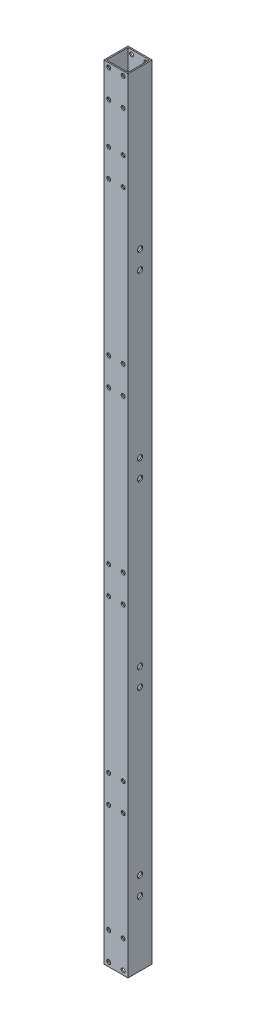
ISO-10303-21;
HEADER;
FILE_DESCRIPTION(('STEP AP214'),'2;1');
FILE_NAME('part.step','',(''),(''),'','','');
FILE_SCHEMA(('AUTOMOTIVE_DESIGN { 1 0 10303 214 1 1 1 1 }'));
ENDSEC;
DATA;
#1=APPLICATION_CONTEXT('core data for automotive mechanical design processes');
#2=APPLICATION_PROTOCOL_DEFINITION('international standard','automotive_design',2000,#1);
#3=PRODUCT_CONTEXT('',#1,'mechanical');
#4=PRODUCT('Part','Part','',(#3));
#5=PRODUCT_RELATED_PRODUCT_CATEGORY('part','',(#4));
#6=PRODUCT_DEFINITION_FORMATION('','',#4);
#7=PRODUCT_DEFINITION_CONTEXT('part definition',#1,'design');
#8=PRODUCT_DEFINITION('design','',#6,#7);
#9=PRODUCT_DEFINITION_SHAPE('','',#8);
#10=(LENGTH_UNIT() NAMED_UNIT(*) SI_UNIT(.MILLI.,.METRE.));
#11=(NAMED_UNIT(*) PLANE_ANGLE_UNIT() SI_UNIT($,.RADIAN.));
#12=(NAMED_UNIT(*) SI_UNIT($,.STERADIAN.) SOLID_ANGLE_UNIT());
#13=UNCERTAINTY_MEASURE_WITH_UNIT(LENGTH_MEASURE(1.E-05),#10,'distance_accuracy_value','');
#14=(GEOMETRIC_REPRESENTATION_CONTEXT(3) GLOBAL_UNCERTAINTY_ASSIGNED_CONTEXT((#13)) GLOBAL_UNIT_ASSIGNED_CONTEXT((#10,
#11,#12)) REPRESENTATION_CONTEXT('',''));
#15=CARTESIAN_POINT('',(0.,0.,0.));
#16=DIRECTION('',(0.,0.,1.));
#17=DIRECTION('',(1.,0.,0.));
#18=AXIS2_PLACEMENT_3D('',#15,#16,#17);
#19=CARTESIAN_POINT('',(-9.,650.,9.));
#20=DIRECTION('',(0.,0.,-1.));
#21=DIRECTION('',(0.,-1.,0.));
#22=AXIS2_PLACEMENT_3D('',#19,#20,#21);
#23=PLANE('',#22);
#24=CARTESIAN_POINT('',(6.,26.5,9.));
#25=DIRECTION('',(0.,0.,-1.));
#26=DIRECTION('',(-1.,0.,0.));
#27=AXIS2_PLACEMENT_3D('',#24,#25,#26);
#28=CIRCLE('',#27,1.65);
#29=CARTESIAN_POINT('',(4.35,26.5,9.));
#30=VERTEX_POINT('',#29);
#31=EDGE_CURVE('E391',#30,#30,#28,.T.);
#32=ORIENTED_EDGE('',*,*,#31,.F.);
#33=EDGE_LOOP('',(#32));
#34=FACE_BOUND('',#33,.T.);
#35=CARTESIAN_POINT('',(-6.,439.5,9.));
#36=DIRECTION('',(0.,0.,-1.));
#37=DIRECTION('',(-1.,0.,0.));
#38=AXIS2_PLACEMENT_3D('',#35,#36,#37);
#39=CIRCLE('',#38,1.65);
#40=CARTESIAN_POINT('',(-7.65,439.5,9.));
#41=VERTEX_POINT('',#40);
#42=EDGE_CURVE('E569',#41,#41,#39,.T.);
#43=ORIENTED_EDGE('',*,*,#42,.F.);
#44=EDGE_LOOP('',(#43));
#45=FACE_BOUND('',#44,.T.);
#46=CARTESIAN_POINT('',(-6.,416.5,9.));
#47=DIRECTION('',(0.,0.,-1.));
#48=DIRECTION('',(-1.,0.,0.));
#49=AXIS2_PLACEMENT_3D('',#46,#47,#48);
#50=CIRCLE('',#49,1.65);
#51=CARTESIAN_POINT('',(-7.65,416.5,9.));
#52=VERTEX_POINT('',#51);
#53=EDGE_CURVE('E311',#52,#52,#50,.T.);
#54=ORIENTED_EDGE('',*,*,#53,.F.);
#55=EDGE_LOOP('',(#54));
#56=FACE_BOUND('',#55,.T.);
#57=CARTESIAN_POINT('',(6.,416.5,9.));
#58=DIRECTION('',(0.,0.,-1.));
#59=DIRECTION('',(-1.,0.,0.));
#60=AXIS2_PLACEMENT_3D('',#57,#58,#59);
#61=CIRCLE('',#60,1.65);
#62=CARTESIAN_POINT('',(4.35,416.5,9.));
#63=VERTEX_POINT('',#62);
#64=EDGE_CURVE('E312',#63,#63,#61,.T.);
#65=ORIENTED_EDGE('',*,*,#64,.F.);
#66=EDGE_LOOP('',(#65));
#67=FACE_BOUND('',#66,.T.);
#68=CARTESIAN_POINT('',(6.,589.5,9.));
#69=DIRECTION('',(0.,0.,-1.));
#70=DIRECTION('',(-1.,0.,0.));
#71=AXIS2_PLACEMENT_3D('',#68,#69,#70);
#72=CIRCLE('',#71,1.65);
#73=CARTESIAN_POINT('',(4.35,589.5,9.));
#74=VERTEX_POINT('',#73);
#75=EDGE_CURVE('E553',#74,#74,#72,.T.);
#76=ORIENTED_EDGE('',*,*,#75,.F.);
#77=EDGE_LOOP('',(#76));
#78=FACE_BOUND('',#77,.T.);
#79=CARTESIAN_POINT('',(-6.,589.5,9.));
#80=DIRECTION('',(0.,0.,-1.));
#81=DIRECTION('',(-1.,0.,0.));
#82=AXIS2_PLACEMENT_3D('',#79,#80,#81);
#83=CIRCLE('',#82,1.65);
#84=CARTESIAN_POINT('',(-7.65,589.5,9.));
#85=VERTEX_POINT('',#84);
#86=EDGE_CURVE('E545',#85,#85,#83,.T.);
#87=ORIENTED_EDGE('',*,*,#86,.F.);
#88=EDGE_LOOP('',(#87));
#89=FACE_BOUND('',#88,.T.);
#90=CARTESIAN_POINT('',(-6.,566.5,9.));
#91=DIRECTION('',(0.,0.,-1.));
#92=DIRECTION('',(-1.,0.,0.));
#93=AXIS2_PLACEMENT_3D('',#90,#91,#92);
#94=CIRCLE('',#93,1.65);
#95=CARTESIAN_POINT('',(-7.65,566.5,9.));
#96=VERTEX_POINT('',#95);
#97=EDGE_CURVE('E367',#96,#96,#94,.T.);
#98=ORIENTED_EDGE('',*,*,#97,.F.);
#99=EDGE_LOOP('',(#98));
#100=FACE_BOUND('',#99,.T.);
#101=CARTESIAN_POINT('',(6.,566.5,9.));
#102=DIRECTION('',(0.,0.,-1.));
#103=DIRECTION('',(-1.,0.,0.));
#104=AXIS2_PLACEMENT_3D('',#101,#102,#103);
#105=CIRCLE('',#104,1.65);
#106=CARTESIAN_POINT('',(4.35,566.5,9.));
#107=VERTEX_POINT('',#106);
#108=EDGE_CURVE('E368',#107,#107,#105,.T.);
#109=ORIENTED_EDGE('',*,*,#108,.F.);
#110=EDGE_LOOP('',(#109));
#111=FACE_BOUND('',#110,.T.);
#112=CARTESIAN_POINT('',(6.,646.5,9.));
#113=DIRECTION('',(0.,0.,-1.));
#114=DIRECTION('',(-1.,0.,0.));
#115=AXIS2_PLACEMENT_3D('',#112,#113,#114);
#116=CIRCLE('',#115,1.65);
#117=CARTESIAN_POINT('',(4.35,646.5,9.));
#118=VERTEX_POINT('',#117);
#119=EDGE_CURVE('E527',#118,#118,#116,.T.);
#120=ORIENTED_EDGE('',*,*,#119,.F.);
#121=EDGE_LOOP('',(#120));
#122=FACE_BOUND('',#121,.T.);
#123=CARTESIAN_POINT('',(6.,116.5,9.));
#124=DIRECTION('',(0.,0.,-1.));
#125=DIRECTION('',(-1.,0.,0.));
#126=AXIS2_PLACEMENT_3D('',#123,#124,#125);
#127=CIRCLE('',#126,1.65);
#128=CARTESIAN_POINT('',(4.35,116.5,9.));
#129=VERTEX_POINT('',#128);
#130=EDGE_CURVE('E519',#129,#129,#127,.T.);
#131=ORIENTED_EDGE('',*,*,#130,.F.);
#132=EDGE_LOOP('',(#131));
#133=FACE_BOUND('',#132,.T.);
#134=CARTESIAN_POINT('',(-6.,116.5,9.));
#135=DIRECTION('',(0.,0.,-1.));
#136=DIRECTION('',(-1.,0.,0.));
#137=AXIS2_PLACEMENT_3D('',#134,#135,#136);
#138=CIRCLE('',#137,1.65);
#139=CARTESIAN_POINT('',(-7.65,116.5,9.));
#140=VERTEX_POINT('',#139);
#141=EDGE_CURVE('E511',#140,#140,#138,.T.);
#142=ORIENTED_EDGE('',*,*,#141,.F.);
#143=EDGE_LOOP('',(#142));
#144=FACE_BOUND('',#143,.T.);
#145=CARTESIAN_POINT('',(-6.,139.5,9.));
#146=DIRECTION('',(0.,0.,-1.));
#147=DIRECTION('',(-1.,0.,0.));
#148=AXIS2_PLACEMENT_3D('',#145,#146,#147);
#149=CIRCLE('',#148,1.65);
#150=CARTESIAN_POINT('',(-7.65,139.5,9.));
#151=VERTEX_POINT('',#150);
#152=EDGE_CURVE('E503',#151,#151,#149,.T.);
#153=ORIENTED_EDGE('',*,*,#152,.F.);
#154=EDGE_LOOP('',(#153));
#155=FACE_BOUND('',#154,.T.);
#156=CARTESIAN_POINT('',(6.,139.5,9.));
#157=DIRECTION('',(0.,0.,-1.));
#158=DIRECTION('',(-1.,0.,0.));
#159=AXIS2_PLACEMENT_3D('',#156,#157,#158);
#160=CIRCLE('',#159,1.65);
#161=CARTESIAN_POINT('',(4.35,139.5,9.));
#162=VERTEX_POINT('',#161);
#163=EDGE_CURVE('E495',#162,#162,#160,.T.);
#164=ORIENTED_EDGE('',*,*,#163,.F.);
#165=EDGE_LOOP('',(#164));
#166=FACE_BOUND('',#165,.T.);
#167=CARTESIAN_POINT('',(6.,3.5,9.));
#168=DIRECTION('',(0.,0.,-1.));
#169=DIRECTION('',(-1.,0.,0.));
#170=AXIS2_PLACEMENT_3D('',#167,#168,#169);
#171=CIRCLE('',#170,1.65);
#172=CARTESIAN_POINT('',(4.35,3.5,9.));
#173=VERTEX_POINT('',#172);
#174=EDGE_CURVE('E170',#173,#173,#171,.T.);
#175=ORIENTED_EDGE('',*,*,#174,.F.);
#176=EDGE_LOOP('',(#175));
#177=FACE_BOUND('',#176,.T.);
#178=CARTESIAN_POINT('',(-6.,3.5,9.));
#179=DIRECTION('',(0.,0.,-1.));
#180=DIRECTION('',(-1.,0.,0.));
#181=AXIS2_PLACEMENT_3D('',#178,#179,#180);
#182=CIRCLE('',#181,1.65);
#183=CARTESIAN_POINT('',(-7.65,3.5,9.));
#184=VERTEX_POINT('',#183);
#185=EDGE_CURVE('E462',#184,#184,#182,.T.);
#186=ORIENTED_EDGE('',*,*,#185,.F.);
#187=EDGE_LOOP('',(#186));
#188=FACE_BOUND('',#187,.T.);
#189=CARTESIAN_POINT('',(-6.,26.5,9.));
#190=DIRECTION('',(0.,0.,-1.));
#191=DIRECTION('',(-1.,0.,0.));
#192=AXIS2_PLACEMENT_3D('',#189,#190,#191);
#193=CIRCLE('',#192,1.65);
#194=CARTESIAN_POINT('',(-7.65,26.5,9.));
#195=VERTEX_POINT('',#194);
#196=EDGE_CURVE('E482',#195,#195,#193,.T.);
#197=ORIENTED_EDGE('',*,*,#196,.F.);
#198=EDGE_LOOP('',(#197));
#199=FACE_BOUND('',#198,.T.);
#200=CARTESIAN_POINT('',(6.,439.5,9.));
#201=DIRECTION('',(0.,0.,-1.));
#202=DIRECTION('',(-1.,0.,0.));
#203=AXIS2_PLACEMENT_3D('',#200,#201,#202);
#204=CIRCLE('',#203,1.65);
#205=CARTESIAN_POINT('',(4.35,439.5,9.));
#206=VERTEX_POINT('',#205);
#207=EDGE_CURVE('E474',#206,#206,#204,.T.);
#208=ORIENTED_EDGE('',*,*,#207,.F.);
#209=EDGE_LOOP('',(#208));
#210=FACE_BOUND('',#209,.T.);
#211=CARTESIAN_POINT('',(6.,266.5,9.));
#212=DIRECTION('',(0.,0.,-1.));
#213=DIRECTION('',(-1.,0.,0.));
#214=AXIS2_PLACEMENT_3D('',#211,#212,#213);
#215=CIRCLE('',#214,1.65);
#216=CARTESIAN_POINT('',(4.35,266.5,9.));
#217=VERTEX_POINT('',#216);
#218=EDGE_CURVE('E278',#217,#217,#215,.T.);
#219=ORIENTED_EDGE('',*,*,#218,.F.);
#220=EDGE_LOOP('',(#219));
#221=FACE_BOUND('',#220,.T.);
#222=CARTESIAN_POINT('',(-6.,266.5,9.));
#223=DIRECTION('',(0.,0.,-1.));
#224=DIRECTION('',(-1.,0.,0.));
#225=AXIS2_PLACEMENT_3D('',#222,#223,#224);
#226=CIRCLE('',#225,1.65);
#227=CARTESIAN_POINT('',(-7.65,266.5,9.));
#228=VERTEX_POINT('',#227);
#229=EDGE_CURVE('E279',#228,#228,#226,.T.);
#230=ORIENTED_EDGE('',*,*,#229,.F.);
#231=EDGE_LOOP('',(#230));
#232=FACE_BOUND('',#231,.T.);
#233=CARTESIAN_POINT('',(-6.,289.5,9.));
#234=DIRECTION('',(0.,0.,-1.));
#235=DIRECTION('',(-1.,0.,0.));
#236=AXIS2_PLACEMENT_3D('',#233,#234,#235);
#237=CIRCLE('',#236,1.65);
#238=CARTESIAN_POINT('',(-7.65,289.5,9.));
#239=VERTEX_POINT('',#238);
#240=EDGE_CURVE('E451',#239,#239,#237,.T.);
#241=ORIENTED_EDGE('',*,*,#240,.F.);
#242=EDGE_LOOP('',(#241));
#243=FACE_BOUND('',#242,.T.);
#244=CARTESIAN_POINT('',(6.,289.5,9.));
#245=DIRECTION('',(0.,0.,-1.));
#246=DIRECTION('',(-1.,0.,0.));
#247=AXIS2_PLACEMENT_3D('',#244,#245,#246);
#248=CIRCLE('',#247,1.65);
#249=CARTESIAN_POINT('',(4.35,289.5,9.));
#250=VERTEX_POINT('',#249);
#251=EDGE_CURVE('E443',#250,#250,#248,.T.);
#252=ORIENTED_EDGE('',*,*,#251,.F.);
#253=EDGE_LOOP('',(#252));
#254=FACE_BOUND('',#253,.T.);
#255=CARTESIAN_POINT('',(6.,623.5,9.));
#256=DIRECTION('',(0.,0.,-1.));
#257=DIRECTION('',(-1.,0.,0.));
#258=AXIS2_PLACEMENT_3D('',#255,#256,#257);
#259=CIRCLE('',#258,1.65);
#260=CARTESIAN_POINT('',(4.35,623.5,9.));
#261=VERTEX_POINT('',#260);
#262=EDGE_CURVE('E438',#261,#261,#259,.T.);
#263=ORIENTED_EDGE('',*,*,#262,.F.);
#264=EDGE_LOOP('',(#263));
#265=FACE_BOUND('',#264,.T.);
#266=CARTESIAN_POINT('',(-6.,623.5,9.));
#267=DIRECTION('',(0.,0.,-1.));
#268=DIRECTION('',(-1.,0.,0.));
#269=AXIS2_PLACEMENT_3D('',#266,#267,#268);
#270=CIRCLE('',#269,1.65);
#271=CARTESIAN_POINT('',(-7.65,623.5,9.));
#272=VERTEX_POINT('',#271);
#273=EDGE_CURVE('E430',#272,#272,#270,.T.);
#274=ORIENTED_EDGE('',*,*,#273,.F.);
#275=EDGE_LOOP('',(#274));
#276=FACE_BOUND('',#275,.T.);
#277=CARTESIAN_POINT('',(-6.,646.5,9.));
#278=DIRECTION('',(0.,0.,-1.));
#279=DIRECTION('',(-1.,0.,0.));
#280=AXIS2_PLACEMENT_3D('',#277,#278,#279);
#281=CIRCLE('',#280,1.65);
#282=CARTESIAN_POINT('',(-7.65,646.5,9.));
#283=VERTEX_POINT('',#282);
#284=EDGE_CURVE('E422',#283,#283,#281,.T.);
#285=ORIENTED_EDGE('',*,*,#284,.F.);
#286=EDGE_LOOP('',(#285));
#287=FACE_BOUND('',#286,.T.);
#288=DIRECTION('',(1.,0.,0.));
#289=VECTOR('',#288,1.);
#290=CARTESIAN_POINT('',(-9.,0.,9.));
#291=LINE('',#290,#289);
#292=CARTESIAN_POINT('',(-9.,0.,9.));
#293=VERTEX_POINT('',#292);
#294=CARTESIAN_POINT('',(9.,0.,9.));
#295=VERTEX_POINT('',#294);
#296=EDGE_CURVE('E608',#293,#295,#291,.T.);
#297=ORIENTED_EDGE('',*,*,#296,.F.);
#298=DIRECTION('',(0.,-1.,0.));
#299=VECTOR('',#298,1.);
#300=CARTESIAN_POINT('',(-9.,650.,9.));
#301=LINE('',#300,#299);
#302=CARTESIAN_POINT('',(-9.,650.,9.));
#303=VERTEX_POINT('',#302);
#304=EDGE_CURVE('E11',#303,#293,#301,.T.);
#305=ORIENTED_EDGE('',*,*,#304,.F.);
#306=DIRECTION('',(1.,0.,0.));
#307=VECTOR('',#306,1.);
#308=CARTESIAN_POINT('',(-9.,650.,9.));
#309=LINE('',#308,#307);
#310=CARTESIAN_POINT('',(9.,650.,9.));
#311=VERTEX_POINT('',#310);
#312=EDGE_CURVE('E584',#303,#311,#309,.T.);
#313=ORIENTED_EDGE('',*,*,#312,.T.);
#314=DIRECTION('',(0.,-1.,0.));
#315=VECTOR('',#314,1.);
#316=CARTESIAN_POINT('',(9.,650.,9.));
#317=LINE('',#316,#315);
#318=EDGE_CURVE('E120',#311,#295,#317,.T.);
#319=ORIENTED_EDGE('',*,*,#318,.T.);
#320=EDGE_LOOP('',(#297,#305,#313,#319));
#321=FACE_BOUND('',#320,.T.);
#322=ADVANCED_FACE('F17',(#34,#45,#56,#67,#78,#89,#100,#111,#122,#133,#144,#155,#166,#177,#188,
#199,#210,#221,#232,#243,#254,#265,#276,#287,#321),#23,.T.);
#323=CARTESIAN_POINT('',(-9.,650.,9.));
#324=DIRECTION('',(1.,0.,0.));
#325=DIRECTION('',(0.,1.,0.));
#326=AXIS2_PLACEMENT_3D('',#323,#324,#325);
#327=PLANE('',#326);
#328=CARTESIAN_POINT('',(-9.,69.,0.));
#329=DIRECTION('',(1.,0.,0.));
#330=DIRECTION('',(0.,0.,-1.));
#331=AXIS2_PLACEMENT_3D('',#328,#329,#330);
#332=CIRCLE('',#331,2.2);
#333=CARTESIAN_POINT('',(-9.,69.,-2.2));
#334=VERTEX_POINT('',#333);
#335=EDGE_CURVE('E168',#334,#334,#332,.T.);
#336=ORIENTED_EDGE('',*,*,#335,.F.);
#337=EDGE_LOOP('',(#336));
#338=FACE_BOUND('',#337,.T.);
#339=CARTESIAN_POINT('',(-9.,354.,0.));
#340=DIRECTION('',(1.,0.,0.));
#341=DIRECTION('',(0.,0.,-1.));
#342=AXIS2_PLACEMENT_3D('',#339,#340,#341);
#343=CIRCLE('',#342,2.2);
#344=CARTESIAN_POINT('',(-9.,354.,-2.2));
#345=VERTEX_POINT('',#344);
#346=EDGE_CURVE('E169',#345,#345,#343,.T.);
#347=ORIENTED_EDGE('',*,*,#346,.F.);
#348=EDGE_LOOP('',(#347));
#349=FACE_BOUND('',#348,.T.);
#350=CARTESIAN_POINT('',(-9.,519.,0.));
#351=DIRECTION('',(1.,0.,0.));
#352=DIRECTION('',(0.,0.,-1.));
#353=AXIS2_PLACEMENT_3D('',#350,#351,#352);
#354=CIRCLE('',#353,2.2);
#355=CARTESIAN_POINT('',(-9.,519.,-2.2));
#356=VERTEX_POINT('',#355);
#357=EDGE_CURVE('E234',#356,#356,#354,.T.);
#358=ORIENTED_EDGE('',*,*,#357,.F.);
#359=EDGE_LOOP('',(#358));
#360=FACE_BOUND('',#359,.T.);
#361=CARTESIAN_POINT('',(-9.,504.,0.));
#362=DIRECTION('',(1.,0.,0.));
#363=DIRECTION('',(0.,0.,-1.));
#364=AXIS2_PLACEMENT_3D('',#361,#362,#363);
#365=CIRCLE('',#364,2.2);
#366=CARTESIAN_POINT('',(-9.,504.,-2.2));
#367=VERTEX_POINT('',#366);
#368=EDGE_CURVE('E157',#367,#367,#365,.T.);
#369=ORIENTED_EDGE('',*,*,#368,.F.);
#370=EDGE_LOOP('',(#369));
#371=FACE_BOUND('',#370,.T.);
#372=CARTESIAN_POINT('',(-9.,54.,0.));
#373=DIRECTION('',(1.,0.,0.));
#374=DIRECTION('',(0.,0.,-1.));
#375=AXIS2_PLACEMENT_3D('',#372,#373,#374);
#376=CIRCLE('',#375,2.2);
#377=CARTESIAN_POINT('',(-9.,54.,-2.2));
#378=VERTEX_POINT('',#377);
#379=EDGE_CURVE('E158',#378,#378,#376,.T.);
#380=ORIENTED_EDGE('',*,*,#379,.F.);
#381=EDGE_LOOP('',(#380));
#382=FACE_BOUND('',#381,.T.);
#383=CARTESIAN_POINT('',(-9.,219.,0.));
#384=DIRECTION('',(1.,0.,0.));
#385=DIRECTION('',(0.,0.,-1.));
#386=AXIS2_PLACEMENT_3D('',#383,#384,#385);
#387=CIRCLE('',#386,2.2);
#388=CARTESIAN_POINT('',(-9.,219.,-2.2));
#389=VERTEX_POINT('',#388);
#390=EDGE_CURVE('E200',#389,#389,#387,.T.);
#391=ORIENTED_EDGE('',*,*,#390,.F.);
#392=EDGE_LOOP('',(#391));
#393=FACE_BOUND('',#392,.T.);
#394=CARTESIAN_POINT('',(-9.,204.,0.));
#395=DIRECTION('',(1.,0.,0.));
#396=DIRECTION('',(0.,0.,-1.));
#397=AXIS2_PLACEMENT_3D('',#394,#395,#396);
#398=CIRCLE('',#397,2.2);
#399=CARTESIAN_POINT('',(-9.,204.,-2.2));
#400=VERTEX_POINT('',#399);
#401=EDGE_CURVE('E192',#400,#400,#398,.T.);
#402=ORIENTED_EDGE('',*,*,#401,.F.);
#403=EDGE_LOOP('',(#402));
#404=FACE_BOUND('',#403,.T.);
#405=CARTESIAN_POINT('',(-9.,369.,0.));
#406=DIRECTION('',(1.,0.,0.));
#407=DIRECTION('',(0.,0.,-1.));
#408=AXIS2_PLACEMENT_3D('',#405,#406,#407);
#409=CIRCLE('',#408,2.2);
#410=CARTESIAN_POINT('',(-9.,369.,-2.2));
#411=VERTEX_POINT('',#410);
#412=EDGE_CURVE('E163',#411,#411,#409,.T.);
#413=ORIENTED_EDGE('',*,*,#412,.F.);
#414=EDGE_LOOP('',(#413));
#415=FACE_BOUND('',#414,.T.);
#416=DIRECTION('',(0.,0.,1.));
#417=VECTOR('',#416,1.);
#418=CARTESIAN_POINT('',(-9.,0.,9.));
#419=LINE('',#418,#417);
#420=CARTESIAN_POINT('',(-9.,0.,-9.));
#421=VERTEX_POINT('',#420);
#422=EDGE_CURVE('E620',#421,#293,#419,.T.);
#423=ORIENTED_EDGE('',*,*,#422,.F.);
#424=DIRECTION('',(0.,-1.,0.));
#425=VECTOR('',#424,1.);
#426=CARTESIAN_POINT('',(-9.,650.,-9.));
#427=LINE('',#426,#425);
#428=CARTESIAN_POINT('',(-9.,650.,-9.));
#429=VERTEX_POINT('',#428);
#430=EDGE_CURVE('E21',#429,#421,#427,.T.);
#431=ORIENTED_EDGE('',*,*,#430,.F.);
#432=DIRECTION('',(0.,0.,1.));
#433=VECTOR('',#432,1.);
#434=CARTESIAN_POINT('',(-9.,650.,9.));
#435=LINE('',#434,#433);
#436=EDGE_CURVE('E588',#429,#303,#435,.T.);
#437=ORIENTED_EDGE('',*,*,#436,.T.);
#438=ORIENTED_EDGE('',*,*,#304,.T.);
#439=EDGE_LOOP('',(#423,#431,#437,#438));
#440=FACE_BOUND('',#439,.T.);
#441=ADVANCED_FACE('F19',(#338,#349,#360,#371,#382,#393,#404,#415,#440),#327,.T.);
#442=CARTESIAN_POINT('',(-9.,650.,-9.));
#443=DIRECTION('',(0.,0.,1.));
#444=DIRECTION('',(1.,0.,0.));
#445=AXIS2_PLACEMENT_3D('',#442,#443,#444);
#446=PLANE('',#445);
#447=CARTESIAN_POINT('',(6.,26.5,-9.));
#448=DIRECTION('',(0.,0.,1.));
#449=DIRECTION('',(1.,0.,0.));
#450=AXIS2_PLACEMENT_3D('',#447,#448,#449);
#451=CIRCLE('',#450,1.65);
#452=CARTESIAN_POINT('',(7.65,26.5,-9.));
#453=VERTEX_POINT('',#452);
#454=EDGE_CURVE('E418',#453,#453,#451,.T.);
#455=ORIENTED_EDGE('',*,*,#454,.F.);
#456=EDGE_LOOP('',(#455));
#457=FACE_BOUND('',#456,.T.);
#458=CARTESIAN_POINT('',(-6.,439.5,-9.));
#459=DIRECTION('',(0.,0.,1.));
#460=DIRECTION('',(1.,0.,0.));
#461=AXIS2_PLACEMENT_3D('',#458,#459,#460);
#462=CIRCLE('',#461,1.65);
#463=CARTESIAN_POINT('',(-4.35,439.5,-9.));
#464=VERTEX_POINT('',#463);
#465=EDGE_CURVE('E410',#464,#464,#462,.T.);
#466=ORIENTED_EDGE('',*,*,#465,.F.);
#467=EDGE_LOOP('',(#466));
#468=FACE_BOUND('',#467,.T.);
#469=CARTESIAN_POINT('',(-6.,416.5,-9.));
#470=DIRECTION('',(0.,0.,1.));
#471=DIRECTION('',(1.,0.,0.));
#472=AXIS2_PLACEMENT_3D('',#469,#470,#471);
#473=CIRCLE('',#472,1.65);
#474=CARTESIAN_POINT('',(-4.35,416.5,-9.));
#475=VERTEX_POINT('',#474);
#476=EDGE_CURVE('E402',#475,#475,#473,.T.);
#477=ORIENTED_EDGE('',*,*,#476,.F.);
#478=EDGE_LOOP('',(#477));
#479=FACE_BOUND('',#478,.T.);
#480=CARTESIAN_POINT('',(6.,416.5,-9.));
#481=DIRECTION('',(0.,0.,1.));
#482=DIRECTION('',(1.,0.,0.));
#483=AXIS2_PLACEMENT_3D('',#480,#481,#482);
#484=CIRCLE('',#483,1.65);
#485=CARTESIAN_POINT('',(7.65,416.5,-9.));
#486=VERTEX_POINT('',#485);
#487=EDGE_CURVE('E255',#486,#486,#484,.T.);
#488=ORIENTED_EDGE('',*,*,#487,.F.);
#489=EDGE_LOOP('',(#488));
#490=FACE_BOUND('',#489,.T.);
#491=CARTESIAN_POINT('',(6.,589.5,-9.));
#492=DIRECTION('',(0.,0.,1.));
#493=DIRECTION('',(1.,0.,0.));
#494=AXIS2_PLACEMENT_3D('',#491,#492,#493);
#495=CIRCLE('',#494,1.65);
#496=CARTESIAN_POINT('',(7.65,589.5,-9.));
#497=VERTEX_POINT('',#496);
#498=EDGE_CURVE('E256',#497,#497,#495,.T.);
#499=ORIENTED_EDGE('',*,*,#498,.F.);
#500=EDGE_LOOP('',(#499));
#501=FACE_BOUND('',#500,.T.);
#502=CARTESIAN_POINT('',(-6.,589.5,-9.));
#503=DIRECTION('',(0.,0.,1.));
#504=DIRECTION('',(1.,0.,0.));
#505=AXIS2_PLACEMENT_3D('',#502,#503,#504);
#506=CIRCLE('',#505,1.65);
#507=CARTESIAN_POINT('',(-4.35,589.5,-9.));
#508=VERTEX_POINT('',#507);
#509=EDGE_CURVE('E379',#508,#508,#506,.T.);
#510=ORIENTED_EDGE('',*,*,#509,.F.);
#511=EDGE_LOOP('',(#510));
#512=FACE_BOUND('',#511,.T.);
#513=CARTESIAN_POINT('',(-6.,566.5,-9.));
#514=DIRECTION('',(0.,0.,1.));
#515=DIRECTION('',(1.,0.,0.));
#516=AXIS2_PLACEMENT_3D('',#513,#514,#515);
#517=CIRCLE('',#516,1.65);
#518=CARTESIAN_POINT('',(-4.35,566.5,-9.));
#519=VERTEX_POINT('',#518);
#520=EDGE_CURVE('E190',#519,#519,#517,.T.);
#521=ORIENTED_EDGE('',*,*,#520,.F.);
#522=EDGE_LOOP('',(#521));
#523=FACE_BOUND('',#522,.T.);
#524=CARTESIAN_POINT('',(6.,566.5,-9.));
#525=DIRECTION('',(0.,0.,1.));
#526=DIRECTION('',(1.,0.,0.));
#527=AXIS2_PLACEMENT_3D('',#524,#525,#526);
#528=CIRCLE('',#527,1.65);
#529=CARTESIAN_POINT('',(7.65,566.5,-9.));
#530=VERTEX_POINT('',#529);
#531=EDGE_CURVE('E191',#530,#530,#528,.T.);
#532=ORIENTED_EDGE('',*,*,#531,.F.);
#533=EDGE_LOOP('',(#532));
#534=FACE_BOUND('',#533,.T.);
#535=CARTESIAN_POINT('',(6.,646.5,-9.));
#536=DIRECTION('',(0.,0.,1.));
#537=DIRECTION('',(1.,0.,0.));
#538=AXIS2_PLACEMENT_3D('',#535,#536,#537);
#539=CIRCLE('',#538,1.65);
#540=CARTESIAN_POINT('',(7.65,646.5,-9.));
#541=VERTEX_POINT('',#540);
#542=EDGE_CURVE('E358',#541,#541,#539,.T.);
#543=ORIENTED_EDGE('',*,*,#542,.F.);
#544=EDGE_LOOP('',(#543));
#545=FACE_BOUND('',#544,.T.);
#546=CARTESIAN_POINT('',(6.,116.5,-9.));
#547=DIRECTION('',(0.,0.,1.));
#548=DIRECTION('',(1.,0.,0.));
#549=AXIS2_PLACEMENT_3D('',#546,#547,#548);
#550=CIRCLE('',#549,1.65);
#551=CARTESIAN_POINT('',(7.65,116.5,-9.));
#552=VERTEX_POINT('',#551);
#553=EDGE_CURVE('E350',#552,#552,#550,.T.);
#554=ORIENTED_EDGE('',*,*,#553,.F.);
#555=EDGE_LOOP('',(#554));
#556=FACE_BOUND('',#555,.T.);
#557=CARTESIAN_POINT('',(-6.,116.5,-9.));
#558=DIRECTION('',(0.,0.,1.));
#559=DIRECTION('',(1.,0.,0.));
#560=AXIS2_PLACEMENT_3D('',#557,#558,#559);
#561=CIRCLE('',#560,1.65);
#562=CARTESIAN_POINT('',(-4.35,116.5,-9.));
#563=VERTEX_POINT('',#562);
#564=EDGE_CURVE('E342',#563,#563,#561,.T.);
#565=ORIENTED_EDGE('',*,*,#564,.F.);
#566=EDGE_LOOP('',(#565));
#567=FACE_BOUND('',#566,.T.);
#568=CARTESIAN_POINT('',(-6.,139.5,-9.));
#569=DIRECTION('',(0.,0.,1.));
#570=DIRECTION('',(1.,0.,0.));
#571=AXIS2_PLACEMENT_3D('',#568,#569,#570);
#572=CIRCLE('',#571,1.65);
#573=CARTESIAN_POINT('',(-4.35,139.5,-9.));
#574=VERTEX_POINT('',#573);
#575=EDGE_CURVE('E337',#574,#574,#572,.T.);
#576=ORIENTED_EDGE('',*,*,#575,.F.);
#577=EDGE_LOOP('',(#576));
#578=FACE_BOUND('',#577,.T.);
#579=CARTESIAN_POINT('',(6.,139.5,-9.));
#580=DIRECTION('',(0.,0.,1.));
#581=DIRECTION('',(1.,0.,0.));
#582=AXIS2_PLACEMENT_3D('',#579,#580,#581);
#583=CIRCLE('',#582,1.65);
#584=CARTESIAN_POINT('',(7.65,139.5,-9.));
#585=VERTEX_POINT('',#584);
#586=EDGE_CURVE('E329',#585,#585,#583,.T.);
#587=ORIENTED_EDGE('',*,*,#586,.F.);
#588=EDGE_LOOP('',(#587));
#589=FACE_BOUND('',#588,.T.);
#590=CARTESIAN_POINT('',(6.,3.5,-9.));
#591=DIRECTION('',(0.,0.,1.));
#592=DIRECTION('',(1.,0.,0.));
#593=AXIS2_PLACEMENT_3D('',#590,#591,#592);
#594=CIRCLE('',#593,1.65);
#595=CARTESIAN_POINT('',(7.65,3.5,-9.));
#596=VERTEX_POINT('',#595);
#597=EDGE_CURVE('E217',#596,#596,#594,.T.);
#598=ORIENTED_EDGE('',*,*,#597,.F.);
#599=EDGE_LOOP('',(#598));
#600=FACE_BOUND('',#599,.T.);
#601=CARTESIAN_POINT('',(-6.,3.5,-9.));
#602=DIRECTION('',(0.,0.,1.));
#603=DIRECTION('',(1.,0.,0.));
#604=AXIS2_PLACEMENT_3D('',#601,#602,#603);
#605=CIRCLE('',#604,1.65);
#606=CARTESIAN_POINT('',(-4.35,3.5,-9.));
#607=VERTEX_POINT('',#606);
#608=EDGE_CURVE('E226',#607,#607,#605,.T.);
#609=ORIENTED_EDGE('',*,*,#608,.F.);
#610=EDGE_LOOP('',(#609));
#611=FACE_BOUND('',#610,.T.);
#612=CARTESIAN_POINT('',(-6.,26.5,-9.));
#613=DIRECTION('',(0.,0.,1.));
#614=DIRECTION('',(1.,0.,0.));
#615=AXIS2_PLACEMENT_3D('',#612,#613,#614);
#616=CIRCLE('',#615,1.65);
#617=CARTESIAN_POINT('',(-4.35,26.5,-9.));
#618=VERTEX_POINT('',#617);
#619=EDGE_CURVE('E235',#618,#618,#616,.T.);
#620=ORIENTED_EDGE('',*,*,#619,.F.);
#621=EDGE_LOOP('',(#620));
#622=FACE_BOUND('',#621,.T.);
#623=CARTESIAN_POINT('',(6.,439.5,-9.));
#624=DIRECTION('',(0.,0.,1.));
#625=DIRECTION('',(1.,0.,0.));
#626=AXIS2_PLACEMENT_3D('',#623,#624,#625);
#627=CIRCLE('',#626,1.65);
#628=CARTESIAN_POINT('',(7.65,439.5,-9.));
#629=VERTEX_POINT('',#628);
#630=EDGE_CURVE('E291',#629,#629,#627,.T.);
#631=ORIENTED_EDGE('',*,*,#630,.F.);
#632=EDGE_LOOP('',(#631));
#633=FACE_BOUND('',#632,.T.);
#634=CARTESIAN_POINT('',(6.,266.5,-9.));
#635=DIRECTION('',(0.,0.,1.));
#636=DIRECTION('',(1.,0.,0.));
#637=AXIS2_PLACEMENT_3D('',#634,#635,#636);
#638=CIRCLE('',#637,1.65);
#639=CARTESIAN_POINT('',(7.65,266.5,-9.));
#640=VERTEX_POINT('',#639);
#641=EDGE_CURVE('E180',#640,#640,#638,.T.);
#642=ORIENTED_EDGE('',*,*,#641,.F.);
#643=EDGE_LOOP('',(#642));
#644=FACE_BOUND('',#643,.T.);
#645=CARTESIAN_POINT('',(-6.,266.5,-9.));
#646=DIRECTION('',(0.,0.,1.));
#647=DIRECTION('',(1.,0.,0.));
#648=AXIS2_PLACEMENT_3D('',#645,#646,#647);
#649=CIRCLE('',#648,1.65);
#650=CARTESIAN_POINT('',(-4.35,266.5,-9.));
#651=VERTEX_POINT('',#650);
#652=EDGE_CURVE('E283',#651,#651,#649,.T.);
#653=ORIENTED_EDGE('',*,*,#652,.F.);
#654=EDGE_LOOP('',(#653));
#655=FACE_BOUND('',#654,.T.);
#656=CARTESIAN_POINT('',(-6.,289.5,-9.));
#657=DIRECTION('',(0.,0.,1.));
#658=DIRECTION('',(1.,0.,0.));
#659=AXIS2_PLACEMENT_3D('',#656,#657,#658);
#660=CIRCLE('',#659,1.65);
#661=CARTESIAN_POINT('',(-4.35,289.5,-9.));
#662=VERTEX_POINT('',#661);
#663=EDGE_CURVE('E299',#662,#662,#660,.T.);
#664=ORIENTED_EDGE('',*,*,#663,.F.);
#665=EDGE_LOOP('',(#664));
#666=FACE_BOUND('',#665,.T.);
#667=CARTESIAN_POINT('',(6.,289.5,-9.));
#668=DIRECTION('',(0.,0.,1.));
#669=DIRECTION('',(1.,0.,0.));
#670=AXIS2_PLACEMENT_3D('',#667,#668,#669);
#671=CIRCLE('',#670,1.65);
#672=CARTESIAN_POINT('',(7.65,289.5,-9.));
#673=VERTEX_POINT('',#672);
#674=EDGE_CURVE('E287',#673,#673,#671,.T.);
#675=ORIENTED_EDGE('',*,*,#674,.F.);
#676=EDGE_LOOP('',(#675));
#677=FACE_BOUND('',#676,.T.);
#678=CARTESIAN_POINT('',(6.,623.5,-9.));
#679=DIRECTION('',(0.,0.,1.));
#680=DIRECTION('',(1.,0.,0.));
#681=AXIS2_PLACEMENT_3D('',#678,#679,#680);
#682=CIRCLE('',#681,1.65);
#683=CARTESIAN_POINT('',(7.65,623.5,-9.));
#684=VERTEX_POINT('',#683);
#685=EDGE_CURVE('E269',#684,#684,#682,.T.);
#686=ORIENTED_EDGE('',*,*,#685,.F.);
#687=EDGE_LOOP('',(#686));
#688=FACE_BOUND('',#687,.T.);
#689=CARTESIAN_POINT('',(-6.,623.5,-9.));
#690=DIRECTION('',(0.,0.,1.));
#691=DIRECTION('',(1.,0.,0.));
#692=AXIS2_PLACEMENT_3D('',#689,#690,#691);
#693=CIRCLE('',#692,1.65);
#694=CARTESIAN_POINT('',(-4.35,623.5,-9.));
#695=VERTEX_POINT('',#694);
#696=EDGE_CURVE('E261',#695,#695,#693,.T.);
#697=ORIENTED_EDGE('',*,*,#696,.F.);
#698=EDGE_LOOP('',(#697));
#699=FACE_BOUND('',#698,.T.);
#700=CARTESIAN_POINT('',(-6.,646.5,-9.));
#701=DIRECTION('',(0.,0.,1.));
#702=DIRECTION('',(1.,0.,0.));
#703=AXIS2_PLACEMENT_3D('',#700,#701,#702);
#704=CIRCLE('',#703,1.65);
#705=CARTESIAN_POINT('',(-4.35,646.5,-9.));
#706=VERTEX_POINT('',#705);
#707=EDGE_CURVE('E212',#706,#706,#704,.T.);
#708=ORIENTED_EDGE('',*,*,#707,.F.);
#709=EDGE_LOOP('',(#708));
#710=FACE_BOUND('',#709,.T.);
#711=DIRECTION('',(-1.,0.,0.));
#712=VECTOR('',#711,1.);
#713=CARTESIAN_POINT('',(-9.,0.,-9.));
#714=LINE('',#713,#712);
#715=CARTESIAN_POINT('',(9.,0.,-9.));
#716=VERTEX_POINT('',#715);
#717=EDGE_CURVE('E616',#716,#421,#714,.T.);
#718=ORIENTED_EDGE('',*,*,#717,.F.);
#719=DIRECTION('',(0.,-1.,0.));
#720=VECTOR('',#719,1.);
#721=CARTESIAN_POINT('',(9.,650.,-9.));
#722=LINE('',#721,#720);
#723=CARTESIAN_POINT('',(9.,650.,-9.));
#724=VERTEX_POINT('',#723);
#725=EDGE_CURVE('E50',#724,#716,#722,.T.);
#726=ORIENTED_EDGE('',*,*,#725,.F.);
#727=DIRECTION('',(-1.,0.,0.));
#728=VECTOR('',#727,1.);
#729=CARTESIAN_POINT('',(-9.,650.,-9.));
#730=LINE('',#729,#728);
#731=EDGE_CURVE('E592',#724,#429,#730,.T.);
#732=ORIENTED_EDGE('',*,*,#731,.T.);
#733=ORIENTED_EDGE('',*,*,#430,.T.);
#734=EDGE_LOOP('',(#718,#726,#732,#733));
#735=FACE_BOUND('',#734,.T.);
#736=ADVANCED_FACE('F1491',(#457,#468,#479,#490,#501,#512,#523,#534,#545,#556,#567,#578,#589,
#600,#611,#622,#633,#644,#655,#666,#677,#688,#699,#710,#735),#446,.T.);
#737=CARTESIAN_POINT('',(9.,650.,9.));
#738=DIRECTION('',(-1.,0.,0.));
#739=DIRECTION('',(0.,0.,1.));
#740=AXIS2_PLACEMENT_3D('',#737,#738,#739);
#741=PLANE('',#740);
#742=CARTESIAN_POINT('',(9.,69.,0.));
#743=DIRECTION('',(-1.,0.,0.));
#744=DIRECTION('',(0.,0.,1.));
#745=AXIS2_PLACEMENT_3D('',#742,#743,#744);
#746=CIRCLE('',#745,2.2);
#747=CARTESIAN_POINT('',(9.,69.,2.2));
#748=VERTEX_POINT('',#747);
#749=EDGE_CURVE('E152',#748,#748,#746,.T.);
#750=ORIENTED_EDGE('',*,*,#749,.F.);
#751=EDGE_LOOP('',(#750));
#752=FACE_BOUND('',#751,.T.);
#753=CARTESIAN_POINT('',(9.,354.,0.));
#754=DIRECTION('',(-1.,0.,0.));
#755=DIRECTION('',(0.,0.,1.));
#756=AXIS2_PLACEMENT_3D('',#753,#754,#755);
#757=CIRCLE('',#756,2.2);
#758=CARTESIAN_POINT('',(9.,354.,2.2));
#759=VERTEX_POINT('',#758);
#760=EDGE_CURVE('E153',#759,#759,#757,.T.);
#761=ORIENTED_EDGE('',*,*,#760,.F.);
#762=EDGE_LOOP('',(#761));
#763=FACE_BOUND('',#762,.T.);
#764=CARTESIAN_POINT('',(9.,519.,0.));
#765=DIRECTION('',(-1.,0.,0.));
#766=DIRECTION('',(0.,0.,1.));
#767=AXIS2_PLACEMENT_3D('',#764,#765,#766);
#768=CIRCLE('',#767,2.2);
#769=CARTESIAN_POINT('',(9.,519.,2.2));
#770=VERTEX_POINT('',#769);
#771=EDGE_CURVE('E2534',#770,#770,#768,.T.);
#772=ORIENTED_EDGE('',*,*,#771,.F.);
#773=EDGE_LOOP('',(#772));
#774=FACE_BOUND('',#773,.T.);
#775=CARTESIAN_POINT('',(9.,504.,0.));
#776=DIRECTION('',(-1.,0.,0.));
#777=DIRECTION('',(0.,0.,1.));
#778=AXIS2_PLACEMENT_3D('',#775,#776,#777);
#779=CIRCLE('',#778,2.2);
#780=CARTESIAN_POINT('',(9.,504.,2.2));
#781=VERTEX_POINT('',#780);
#782=EDGE_CURVE('E2550',#781,#781,#779,.T.);
#783=ORIENTED_EDGE('',*,*,#782,.F.);
#784=EDGE_LOOP('',(#783));
#785=FACE_BOUND('',#784,.T.);
#786=CARTESIAN_POINT('',(9.,54.,0.));
#787=DIRECTION('',(-1.,0.,0.));
#788=DIRECTION('',(0.,0.,1.));
#789=AXIS2_PLACEMENT_3D('',#786,#787,#788);
#790=CIRCLE('',#789,2.2);
#791=CARTESIAN_POINT('',(9.,54.,2.2));
#792=VERTEX_POINT('',#791);
#793=EDGE_CURVE('E2584',#792,#792,#790,.T.);
#794=ORIENTED_EDGE('',*,*,#793,.F.);
#795=EDGE_LOOP('',(#794));
#796=FACE_BOUND('',#795,.T.);
#797=CARTESIAN_POINT('',(9.,219.,0.));
#798=DIRECTION('',(-1.,0.,0.));
#799=DIRECTION('',(0.,0.,1.));
#800=AXIS2_PLACEMENT_3D('',#797,#798,#799);
#801=CIRCLE('',#800,2.2);
#802=CARTESIAN_POINT('',(9.,219.,2.2));
#803=VERTEX_POINT('',#802);
#804=EDGE_CURVE('E2622',#803,#803,#801,.T.);
#805=ORIENTED_EDGE('',*,*,#804,.F.);
#806=EDGE_LOOP('',(#805));
#807=FACE_BOUND('',#806,.T.);
#808=CARTESIAN_POINT('',(9.,204.,0.));
#809=DIRECTION('',(-1.,0.,0.));
#810=DIRECTION('',(0.,0.,1.));
#811=AXIS2_PLACEMENT_3D('',#808,#809,#810);
#812=CIRCLE('',#811,2.2);
#813=CARTESIAN_POINT('',(9.,204.,2.2));
#814=VERTEX_POINT('',#813);
#815=EDGE_CURVE('E2652',#814,#814,#812,.T.);
#816=ORIENTED_EDGE('',*,*,#815,.F.);
#817=EDGE_LOOP('',(#816));
#818=FACE_BOUND('',#817,.T.);
#819=CARTESIAN_POINT('',(9.,369.,0.));
#820=DIRECTION('',(-1.,0.,0.));
#821=DIRECTION('',(0.,0.,1.));
#822=AXIS2_PLACEMENT_3D('',#819,#820,#821);
#823=CIRCLE('',#822,2.2);
#824=CARTESIAN_POINT('',(9.,369.,2.2));
#825=VERTEX_POINT('',#824);
#826=EDGE_CURVE('E2678',#825,#825,#823,.T.);
#827=ORIENTED_EDGE('',*,*,#826,.F.);
#828=EDGE_LOOP('',(#827));
#829=FACE_BOUND('',#828,.T.);
#830=DIRECTION('',(0.,0.,-1.));
#831=VECTOR('',#830,1.);
#832=CARTESIAN_POINT('',(9.,0.,9.));
#833=LINE('',#832,#831);
#834=EDGE_CURVE('E612',#295,#716,#833,.T.);
#835=ORIENTED_EDGE('',*,*,#834,.F.);
#836=ORIENTED_EDGE('',*,*,#318,.F.);
#837=DIRECTION('',(0.,0.,-1.));
#838=VECTOR('',#837,1.);
#839=CARTESIAN_POINT('',(9.,650.,9.));
#840=LINE('',#839,#838);
#841=EDGE_CURVE('E131',#311,#724,#840,.T.);
#842=ORIENTED_EDGE('',*,*,#841,.T.);
#843=ORIENTED_EDGE('',*,*,#725,.T.);
#844=EDGE_LOOP('',(#835,#836,#842,#843));
#845=FACE_BOUND('',#844,.T.);
#846=ADVANCED_FACE('F1481',(#752,#763,#774,#785,#796,#807,#818,#829,#845),#741,.T.);
#847=CARTESIAN_POINT('',(-10.,650.,10.));
#848=DIRECTION('',(0.,0.,-1.));
#849=DIRECTION('',(0.,-1.,0.));
#850=AXIS2_PLACEMENT_3D('',#847,#848,#849);
#851=PLANE('',#850);
#852=CARTESIAN_POINT('',(6.,26.5,10.));
#853=DIRECTION('',(0.,0.,1.));
#854=DIRECTION('',(1.,0.,0.));
#855=AXIS2_PLACEMENT_3D('',#852,#853,#854);
#856=CIRCLE('',#855,1.65);
#857=CARTESIAN_POINT('',(7.65,26.5,10.));
#858=VERTEX_POINT('',#857);
#859=EDGE_CURVE('E387',#858,#858,#856,.T.);
#860=ORIENTED_EDGE('',*,*,#859,.F.);
#861=EDGE_LOOP('',(#860));
#862=FACE_BOUND('',#861,.T.);
#863=CARTESIAN_POINT('',(-6.,439.5,10.));
#864=DIRECTION('',(0.,0.,1.));
#865=DIRECTION('',(1.,0.,0.));
#866=AXIS2_PLACEMENT_3D('',#863,#864,#865);
#867=CIRCLE('',#866,1.65);
#868=CARTESIAN_POINT('',(-4.35,439.5,10.));
#869=VERTEX_POINT('',#868);
#870=EDGE_CURVE('E573',#869,#869,#867,.T.);
#871=ORIENTED_EDGE('',*,*,#870,.F.);
#872=EDGE_LOOP('',(#871));
#873=FACE_BOUND('',#872,.T.);
#874=CARTESIAN_POINT('',(-6.,416.5,10.));
#875=DIRECTION('',(0.,0.,1.));
#876=DIRECTION('',(1.,0.,0.));
#877=AXIS2_PLACEMENT_3D('',#874,#875,#876);
#878=CIRCLE('',#877,1.65);
#879=CARTESIAN_POINT('',(-4.35,416.5,10.));
#880=VERTEX_POINT('',#879);
#881=EDGE_CURVE('E319',#880,#880,#878,.T.);
#882=ORIENTED_EDGE('',*,*,#881,.F.);
#883=EDGE_LOOP('',(#882));
#884=FACE_BOUND('',#883,.T.);
#885=CARTESIAN_POINT('',(6.,416.5,10.));
#886=DIRECTION('',(0.,0.,1.));
#887=DIRECTION('',(1.,0.,0.));
#888=AXIS2_PLACEMENT_3D('',#885,#886,#887);
#889=CIRCLE('',#888,1.65);
#890=CARTESIAN_POINT('',(7.65,416.5,10.));
#891=VERTEX_POINT('',#890);
#892=EDGE_CURVE('E307',#891,#891,#889,.T.);
#893=ORIENTED_EDGE('',*,*,#892,.F.);
#894=EDGE_LOOP('',(#893));
#895=FACE_BOUND('',#894,.T.);
#896=CARTESIAN_POINT('',(6.,589.5,10.));
#897=DIRECTION('',(0.,0.,1.));
#898=DIRECTION('',(1.,0.,0.));
#899=AXIS2_PLACEMENT_3D('',#896,#897,#898);
#900=CIRCLE('',#899,1.65);
#901=CARTESIAN_POINT('',(7.65,589.5,10.));
#902=VERTEX_POINT('',#901);
#903=EDGE_CURVE('E559',#902,#902,#900,.T.);
#904=ORIENTED_EDGE('',*,*,#903,.F.);
#905=EDGE_LOOP('',(#904));
#906=FACE_BOUND('',#905,.T.);
#907=CARTESIAN_POINT('',(-6.,589.5,10.));
#908=DIRECTION('',(0.,0.,1.));
#909=DIRECTION('',(1.,0.,0.));
#910=AXIS2_PLACEMENT_3D('',#907,#908,#909);
#911=CIRCLE('',#910,1.65);
#912=CARTESIAN_POINT('',(-4.35,589.5,10.));
#913=VERTEX_POINT('',#912);
#914=EDGE_CURVE('E549',#913,#913,#911,.T.);
#915=ORIENTED_EDGE('',*,*,#914,.F.);
#916=EDGE_LOOP('',(#915));
#917=FACE_BOUND('',#916,.T.);
#918=CARTESIAN_POINT('',(-6.,566.5,10.));
#919=DIRECTION('',(0.,0.,1.));
#920=DIRECTION('',(1.,0.,0.));
#921=AXIS2_PLACEMENT_3D('',#918,#919,#920);
#922=CIRCLE('',#921,1.65);
#923=CARTESIAN_POINT('',(-4.35,566.5,10.));
#924=VERTEX_POINT('',#923);
#925=EDGE_CURVE('E541',#924,#924,#922,.T.);
#926=ORIENTED_EDGE('',*,*,#925,.F.);
#927=EDGE_LOOP('',(#926));
#928=FACE_BOUND('',#927,.T.);
#929=CARTESIAN_POINT('',(6.,566.5,10.));
#930=DIRECTION('',(0.,0.,1.));
#931=DIRECTION('',(1.,0.,0.));
#932=AXIS2_PLACEMENT_3D('',#929,#930,#931);
#933=CIRCLE('',#932,1.65);
#934=CARTESIAN_POINT('',(7.65,566.5,10.));
#935=VERTEX_POINT('',#934);
#936=EDGE_CURVE('E363',#935,#935,#933,.T.);
#937=ORIENTED_EDGE('',*,*,#936,.F.);
#938=EDGE_LOOP('',(#937));
#939=FACE_BOUND('',#938,.T.);
#940=CARTESIAN_POINT('',(6.,646.5,10.));
#941=DIRECTION('',(0.,0.,1.));
#942=DIRECTION('',(-1.,0.,0.));
#943=AXIS2_PLACEMENT_3D('',#940,#941,#942);
#944=CIRCLE('',#943,1.65);
#945=CARTESIAN_POINT('',(4.35,646.5,10.));
#946=VERTEX_POINT('',#945);
#947=EDGE_CURVE('E531',#946,#946,#944,.T.);
#948=ORIENTED_EDGE('',*,*,#947,.F.);
#949=EDGE_LOOP('',(#948));
#950=FACE_BOUND('',#949,.T.);
#951=CARTESIAN_POINT('',(6.,116.5,10.));
#952=DIRECTION('',(0.,0.,1.));
#953=DIRECTION('',(1.,0.,0.));
#954=AXIS2_PLACEMENT_3D('',#951,#952,#953);
#955=CIRCLE('',#954,1.65);
#956=CARTESIAN_POINT('',(7.65,116.5,10.));
#957=VERTEX_POINT('',#956);
#958=EDGE_CURVE('E523',#957,#957,#955,.T.);
#959=ORIENTED_EDGE('',*,*,#958,.F.);
#960=EDGE_LOOP('',(#959));
#961=FACE_BOUND('',#960,.T.);
#962=CARTESIAN_POINT('',(-6.,116.5,10.));
#963=DIRECTION('',(0.,0.,1.));
#964=DIRECTION('',(1.,0.,0.));
#965=AXIS2_PLACEMENT_3D('',#962,#963,#964);
#966=CIRCLE('',#965,1.65);
#967=CARTESIAN_POINT('',(-4.35,116.5,10.));
#968=VERTEX_POINT('',#967);
#969=EDGE_CURVE('E515',#968,#968,#966,.T.);
#970=ORIENTED_EDGE('',*,*,#969,.F.);
#971=EDGE_LOOP('',(#970));
#972=FACE_BOUND('',#971,.T.);
#973=CARTESIAN_POINT('',(-6.,139.5,10.));
#974=DIRECTION('',(0.,0.,1.));
#975=DIRECTION('',(1.,0.,0.));
#976=AXIS2_PLACEMENT_3D('',#973,#974,#975);
#977=CIRCLE('',#976,1.65);
#978=CARTESIAN_POINT('',(-4.35,139.5,10.));
#979=VERTEX_POINT('',#978);
#980=EDGE_CURVE('E507',#979,#979,#977,.T.);
#981=ORIENTED_EDGE('',*,*,#980,.F.);
#982=EDGE_LOOP('',(#981));
#983=FACE_BOUND('',#982,.T.);
#984=CARTESIAN_POINT('',(6.,139.5,10.));
#985=DIRECTION('',(0.,0.,1.));
#986=DIRECTION('',(1.,0.,0.));
#987=AXIS2_PLACEMENT_3D('',#984,#985,#986);
#988=CIRCLE('',#987,1.65);
#989=CARTESIAN_POINT('',(7.65,139.5,10.));
#990=VERTEX_POINT('',#989);
#991=EDGE_CURVE('E499',#990,#990,#988,.T.);
#992=ORIENTED_EDGE('',*,*,#991,.F.);
#993=EDGE_LOOP('',(#992));
#994=FACE_BOUND('',#993,.T.);
#995=CARTESIAN_POINT('',(6.,3.5,10.));
#996=DIRECTION('',(0.,0.,1.));
#997=DIRECTION('',(1.,0.,0.));
#998=AXIS2_PLACEMENT_3D('',#995,#996,#997);
#999=CIRCLE('',#998,1.65);
#1000=CARTESIAN_POINT('',(7.65,3.5,10.));
#1001=VERTEX_POINT('',#1000);
#1002=EDGE_CURVE('E174',#1001,#1001,#999,.T.);
#1003=ORIENTED_EDGE('',*,*,#1002,.F.);
#1004=EDGE_LOOP('',(#1003));
#1005=FACE_BOUND('',#1004,.T.);
#1006=CARTESIAN_POINT('',(-6.,3.5,10.));
#1007=DIRECTION('',(0.,0.,1.));
#1008=DIRECTION('',(1.,0.,0.));
#1009=AXIS2_PLACEMENT_3D('',#1006,#1007,#1008);
#1010=CIRCLE('',#1009,1.65);
#1011=CARTESIAN_POINT('',(-4.35,3.5,10.));
#1012=VERTEX_POINT('',#1011);
#1013=EDGE_CURVE('E175',#1012,#1012,#1010,.T.);
#1014=ORIENTED_EDGE('',*,*,#1013,.F.);
#1015=EDGE_LOOP('',(#1014));
#1016=FACE_BOUND('',#1015,.T.);
#1017=CARTESIAN_POINT('',(-6.,26.5,10.));
#1018=DIRECTION('',(0.,0.,1.));
#1019=DIRECTION('',(1.,0.,0.));
#1020=AXIS2_PLACEMENT_3D('',#1017,#1018,#1019);
#1021=CIRCLE('',#1020,1.65);
#1022=CARTESIAN_POINT('',(-4.35,26.5,10.));
#1023=VERTEX_POINT('',#1022);
#1024=EDGE_CURVE('E466',#1023,#1023,#1021,.T.);
#1025=ORIENTED_EDGE('',*,*,#1024,.F.);
#1026=EDGE_LOOP('',(#1025));
#1027=FACE_BOUND('',#1026,.T.);
#1028=CARTESIAN_POINT('',(6.,439.5,10.));
#1029=DIRECTION('',(0.,0.,1.));
#1030=DIRECTION('',(1.,0.,0.));
#1031=AXIS2_PLACEMENT_3D('',#1028,#1029,#1030);
#1032=CIRCLE('',#1031,1.65);
#1033=CARTESIAN_POINT('',(7.65,439.5,10.));
#1034=VERTEX_POINT('',#1033);
#1035=EDGE_CURVE('E478',#1034,#1034,#1032,.T.);
#1036=ORIENTED_EDGE('',*,*,#1035,.F.);
#1037=EDGE_LOOP('',(#1036));
#1038=FACE_BOUND('',#1037,.T.);
#1039=CARTESIAN_POINT('',(6.,266.5,10.));
#1040=DIRECTION('',(0.,0.,1.));
#1041=DIRECTION('',(1.,0.,0.));
#1042=AXIS2_PLACEMENT_3D('',#1039,#1040,#1041);
#1043=CIRCLE('',#1042,1.65);
#1044=CARTESIAN_POINT('',(7.65,266.5,10.));
#1045=VERTEX_POINT('',#1044);
#1046=EDGE_CURVE('E470',#1045,#1045,#1043,.T.);
#1047=ORIENTED_EDGE('',*,*,#1046,.F.);
#1048=EDGE_LOOP('',(#1047));
#1049=FACE_BOUND('',#1048,.T.);
#1050=CARTESIAN_POINT('',(-6.,266.5,10.));
#1051=DIRECTION('',(0.,0.,1.));
#1052=DIRECTION('',(1.,0.,0.));
#1053=AXIS2_PLACEMENT_3D('',#1050,#1051,#1052);
#1054=CIRCLE('',#1053,1.65);
#1055=CARTESIAN_POINT('',(-4.35,266.5,10.));
#1056=VERTEX_POINT('',#1055);
#1057=EDGE_CURVE('E274',#1056,#1056,#1054,.T.);
#1058=ORIENTED_EDGE('',*,*,#1057,.F.);
#1059=EDGE_LOOP('',(#1058));
#1060=FACE_BOUND('',#1059,.T.);
#1061=CARTESIAN_POINT('',(-6.,289.5,10.));
#1062=DIRECTION('',(0.,0.,1.));
#1063=DIRECTION('',(1.,0.,0.));
#1064=AXIS2_PLACEMENT_3D('',#1061,#1062,#1063);
#1065=CIRCLE('',#1064,1.65);
#1066=CARTESIAN_POINT('',(-4.35,289.5,10.));
#1067=VERTEX_POINT('',#1066);
#1068=EDGE_CURVE('E455',#1067,#1067,#1065,.T.);
#1069=ORIENTED_EDGE('',*,*,#1068,.F.);
#1070=EDGE_LOOP('',(#1069));
#1071=FACE_BOUND('',#1070,.T.);
#1072=CARTESIAN_POINT('',(6.,289.5,10.));
#1073=DIRECTION('',(0.,0.,1.));
#1074=DIRECTION('',(1.,0.,0.));
#1075=AXIS2_PLACEMENT_3D('',#1072,#1073,#1074);
#1076=CIRCLE('',#1075,1.65);
#1077=CARTESIAN_POINT('',(7.65,289.5,10.));
#1078=VERTEX_POINT('',#1077);
#1079=EDGE_CURVE('E447',#1078,#1078,#1076,.T.);
#1080=ORIENTED_EDGE('',*,*,#1079,.F.);
#1081=EDGE_LOOP('',(#1080));
#1082=FACE_BOUND('',#1081,.T.);
#1083=CARTESIAN_POINT('',(6.,623.5,10.));
#1084=DIRECTION('',(0.,0.,1.));
#1085=DIRECTION('',(-1.,0.,0.));
#1086=AXIS2_PLACEMENT_3D('',#1083,#1084,#1085);
#1087=CIRCLE('',#1086,1.65);
#1088=CARTESIAN_POINT('',(4.35,623.5,10.));
#1089=VERTEX_POINT('',#1088);
#1090=EDGE_CURVE('E442',#1089,#1089,#1087,.T.);
#1091=ORIENTED_EDGE('',*,*,#1090,.F.);
#1092=EDGE_LOOP('',(#1091));
#1093=FACE_BOUND('',#1092,.T.);
#1094=CARTESIAN_POINT('',(-6.,623.5,10.));
#1095=DIRECTION('',(0.,0.,1.));
#1096=DIRECTION('',(-1.,0.,0.));
#1097=AXIS2_PLACEMENT_3D('',#1094,#1095,#1096);
#1098=CIRCLE('',#1097,1.65);
#1099=CARTESIAN_POINT('',(-7.65,623.5,10.));
#1100=VERTEX_POINT('',#1099);
#1101=EDGE_CURVE('E434',#1100,#1100,#1098,.T.);
#1102=ORIENTED_EDGE('',*,*,#1101,.F.);
#1103=EDGE_LOOP('',(#1102));
#1104=FACE_BOUND('',#1103,.T.);
#1105=CARTESIAN_POINT('',(-6.,646.5,10.));
#1106=DIRECTION('',(0.,0.,1.));
#1107=DIRECTION('',(-1.,0.,0.));
#1108=AXIS2_PLACEMENT_3D('',#1105,#1106,#1107);
#1109=CIRCLE('',#1108,1.65);
#1110=CARTESIAN_POINT('',(-7.65,646.5,10.));
#1111=VERTEX_POINT('',#1110);
#1112=EDGE_CURVE('E426',#1111,#1111,#1109,.T.);
#1113=ORIENTED_EDGE('',*,*,#1112,.F.);
#1114=EDGE_LOOP('',(#1113));
#1115=FACE_BOUND('',#1114,.T.);
#1116=DIRECTION('',(1.,0.,0.));
#1117=VECTOR('',#1116,1.);
#1118=CARTESIAN_POINT('',(-10.,0.,10.));
#1119=LINE('',#1118,#1117);
#1120=CARTESIAN_POINT('',(-10.,0.,10.));
#1121=VERTEX_POINT('',#1120);
#1122=CARTESIAN_POINT('',(10.,0.,10.));
#1123=VERTEX_POINT('',#1122);
#1124=EDGE_CURVE('E599',#1121,#1123,#1119,.T.);
#1125=ORIENTED_EDGE('',*,*,#1124,.T.);
#1126=DIRECTION('',(0.,-1.,0.));
#1127=VECTOR('',#1126,1.);
#1128=CARTESIAN_POINT('',(10.,650.,10.));
#1129=LINE('',#1128,#1127);
#1130=CARTESIAN_POINT('',(10.,650.,10.));
#1131=VERTEX_POINT('',#1130);
#1132=EDGE_CURVE('E126',#1131,#1123,#1129,.T.);
#1133=ORIENTED_EDGE('',*,*,#1132,.F.);
#1134=DIRECTION('',(1.,0.,0.));
#1135=VECTOR('',#1134,1.);
#1136=CARTESIAN_POINT('',(-10.,650.,10.));
#1137=LINE('',#1136,#1135);
#1138=CARTESIAN_POINT('',(-10.,650.,10.));
#1139=VERTEX_POINT('',#1138);
#1140=EDGE_CURVE('E124',#1139,#1131,#1137,.T.);
#1141=ORIENTED_EDGE('',*,*,#1140,.F.);
#1142=DIRECTION('',(0.,-1.,0.));
#1143=VECTOR('',#1142,1.);
#1144=CARTESIAN_POINT('',(-10.,650.,10.));
#1145=LINE('',#1144,#1143);
#1146=EDGE_CURVE('E108',#1139,#1121,#1145,.T.);
#1147=ORIENTED_EDGE('',*,*,#1146,.T.);
#1148=EDGE_LOOP('',(#1125,#1133,#1141,#1147));
#1149=FACE_BOUND('',#1148,.T.);
#1150=ADVANCED_FACE('F125',(#862,#873,#884,#895,#906,#917,#928,#939,#950,#961,#972,#983,#994,
#1005,#1016,#1027,#1038,#1049,#1060,#1071,#1082,#1093,#1104,#1115,#1149),#851,.F.);
#1151=CARTESIAN_POINT('',(-10.,650.,10.));
#1152=DIRECTION('',(1.,0.,0.));
#1153=DIRECTION('',(0.,1.,0.));
#1154=AXIS2_PLACEMENT_3D('',#1151,#1152,#1153);
#1155=PLANE('',#1154);
#1156=CARTESIAN_POINT('',(-10.,69.,0.));
#1157=DIRECTION('',(-1.,0.,0.));
#1158=DIRECTION('',(0.,0.,1.));
#1159=AXIS2_PLACEMENT_3D('',#1156,#1157,#1158);
#1160=CIRCLE('',#1159,2.2);
#1161=CARTESIAN_POINT('',(-10.,69.,2.2));
#1162=VERTEX_POINT('',#1161);
#1163=EDGE_CURVE('E213',#1162,#1162,#1160,.T.);
#1164=ORIENTED_EDGE('',*,*,#1163,.F.);
#1165=EDGE_LOOP('',(#1164));
#1166=FACE_BOUND('',#1165,.T.);
#1167=CARTESIAN_POINT('',(-10.,354.,0.));
#1168=DIRECTION('',(-1.,0.,0.));
#1169=DIRECTION('',(0.,0.,1.));
#1170=AXIS2_PLACEMENT_3D('',#1167,#1168,#1169);
#1171=CIRCLE('',#1170,2.2);
#1172=CARTESIAN_POINT('',(-10.,354.,2.2));
#1173=VERTEX_POINT('',#1172);
#1174=EDGE_CURVE('E164',#1173,#1173,#1171,.T.);
#1175=ORIENTED_EDGE('',*,*,#1174,.F.);
#1176=EDGE_LOOP('',(#1175));
#1177=FACE_BOUND('',#1176,.T.);
#1178=CARTESIAN_POINT('',(-10.,519.,0.));
#1179=DIRECTION('',(-1.,0.,0.));
#1180=DIRECTION('',(0.,0.,1.));
#1181=AXIS2_PLACEMENT_3D('',#1178,#1179,#1180);
#1182=CIRCLE('',#1181,2.2);
#1183=CARTESIAN_POINT('',(-10.,519.,2.2));
#1184=VERTEX_POINT('',#1183);
#1185=EDGE_CURVE('E241',#1184,#1184,#1182,.T.);
#1186=ORIENTED_EDGE('',*,*,#1185,.F.);
#1187=EDGE_LOOP('',(#1186));
#1188=FACE_BOUND('',#1187,.T.);
#1189=CARTESIAN_POINT('',(-10.,504.,0.));
#1190=DIRECTION('',(-1.,0.,0.));
#1191=DIRECTION('',(0.,0.,1.));
#1192=AXIS2_PLACEMENT_3D('',#1189,#1190,#1191);
#1193=CIRCLE('',#1192,2.2);
#1194=CARTESIAN_POINT('',(-10.,504.,2.2));
#1195=VERTEX_POINT('',#1194);
#1196=EDGE_CURVE('E230',#1195,#1195,#1193,.T.);
#1197=ORIENTED_EDGE('',*,*,#1196,.F.);
#1198=EDGE_LOOP('',(#1197));
#1199=FACE_BOUND('',#1198,.T.);
#1200=CARTESIAN_POINT('',(-10.,54.,0.));
#1201=DIRECTION('',(-1.,0.,0.));
#1202=DIRECTION('',(0.,0.,1.));
#1203=AXIS2_PLACEMENT_3D('',#1200,#1201,#1202);
#1204=CIRCLE('',#1203,2.2);
#1205=CARTESIAN_POINT('',(-10.,54.,2.2));
#1206=VERTEX_POINT('',#1205);
#1207=EDGE_CURVE('E154',#1206,#1206,#1204,.T.);
#1208=ORIENTED_EDGE('',*,*,#1207,.F.);
#1209=EDGE_LOOP('',(#1208));
#1210=FACE_BOUND('',#1209,.T.);
#1211=CARTESIAN_POINT('',(-10.,219.,0.));
#1212=DIRECTION('',(-1.,0.,0.));
#1213=DIRECTION('',(0.,0.,1.));
#1214=AXIS2_PLACEMENT_3D('',#1211,#1212,#1213);
#1215=CIRCLE('',#1214,2.2);
#1216=CARTESIAN_POINT('',(-10.,219.,2.2));
#1217=VERTEX_POINT('',#1216);
#1218=EDGE_CURVE('E204',#1217,#1217,#1215,.T.);
#1219=ORIENTED_EDGE('',*,*,#1218,.F.);
#1220=EDGE_LOOP('',(#1219));
#1221=FACE_BOUND('',#1220,.T.);
#1222=CARTESIAN_POINT('',(-10.,204.,0.));
#1223=DIRECTION('',(-1.,0.,0.));
#1224=DIRECTION('',(0.,0.,1.));
#1225=AXIS2_PLACEMENT_3D('',#1222,#1223,#1224);
#1226=CIRCLE('',#1225,2.2);
#1227=CARTESIAN_POINT('',(-10.,204.,2.2));
#1228=VERTEX_POINT('',#1227);
#1229=EDGE_CURVE('E196',#1228,#1228,#1226,.T.);
#1230=ORIENTED_EDGE('',*,*,#1229,.F.);
#1231=EDGE_LOOP('',(#1230));
#1232=FACE_BOUND('',#1231,.T.);
#1233=CARTESIAN_POINT('',(-10.,369.,0.));
#1234=DIRECTION('',(-1.,0.,0.));
#1235=DIRECTION('',(0.,0.,1.));
#1236=AXIS2_PLACEMENT_3D('',#1233,#1234,#1235);
#1237=CIRCLE('',#1236,2.2);
#1238=CARTESIAN_POINT('',(-10.,369.,2.2));
#1239=VERTEX_POINT('',#1238);
#1240=EDGE_CURVE('E179',#1239,#1239,#1237,.T.);
#1241=ORIENTED_EDGE('',*,*,#1240,.F.);
#1242=EDGE_LOOP('',(#1241));
#1243=FACE_BOUND('',#1242,.T.);
#1244=DIRECTION('',(0.,0.,1.));
#1245=VECTOR('',#1244,1.);
#1246=CARTESIAN_POINT('',(-10.,0.,10.));
#1247=LINE('',#1246,#1245);
#1248=CARTESIAN_POINT('',(-10.,0.,-10.));
#1249=VERTEX_POINT('',#1248);
#1250=EDGE_CURVE('E115',#1249,#1121,#1247,.T.);
#1251=ORIENTED_EDGE('',*,*,#1250,.T.);
#1252=ORIENTED_EDGE('',*,*,#1146,.F.);
#1253=DIRECTION('',(0.,0.,1.));
#1254=VECTOR('',#1253,1.);
#1255=CARTESIAN_POINT('',(-10.,650.,10.));
#1256=LINE('',#1255,#1254);
#1257=CARTESIAN_POINT('',(-10.,650.,-10.));
#1258=VERTEX_POINT('',#1257);
#1259=EDGE_CURVE('E112',#1258,#1139,#1256,.T.);
#1260=ORIENTED_EDGE('',*,*,#1259,.F.);
#1261=DIRECTION('',(0.,-1.,0.));
#1262=VECTOR('',#1261,1.);
#1263=CARTESIAN_POINT('',(-10.,650.,-10.));
#1264=LINE('',#1263,#1262);
#1265=EDGE_CURVE('E121',#1258,#1249,#1264,.T.);
#1266=ORIENTED_EDGE('',*,*,#1265,.T.);
#1267=EDGE_LOOP('',(#1251,#1252,#1260,#1266));
#1268=FACE_BOUND('',#1267,.T.);
#1269=ADVANCED_FACE('F110',(#1166,#1177,#1188,#1199,#1210,#1221,#1232,#1243,#1268),#1155,.F.);
#1270=CARTESIAN_POINT('',(-10.,650.,-10.));
#1271=DIRECTION('',(0.,0.,1.));
#1272=DIRECTION('',(1.,0.,0.));
#1273=AXIS2_PLACEMENT_3D('',#1270,#1271,#1272);
#1274=PLANE('',#1273);
#1275=CARTESIAN_POINT('',(6.,26.5,-10.));
#1276=DIRECTION('',(0.,0.,1.));
#1277=DIRECTION('',(1.,0.,0.));
#1278=AXIS2_PLACEMENT_3D('',#1275,#1276,#1277);
#1279=CIRCLE('',#1278,1.65);
#1280=CARTESIAN_POINT('',(7.65,26.5,-10.));
#1281=VERTEX_POINT('',#1280);
#1282=EDGE_CURVE('E414',#1281,#1281,#1279,.T.);
#1283=ORIENTED_EDGE('',*,*,#1282,.T.);
#1284=EDGE_LOOP('',(#1283));
#1285=FACE_BOUND('',#1284,.T.);
#1286=CARTESIAN_POINT('',(-6.,439.5,-10.));
#1287=DIRECTION('',(0.,0.,1.));
#1288=DIRECTION('',(1.,0.,0.));
#1289=AXIS2_PLACEMENT_3D('',#1286,#1287,#1288);
#1290=CIRCLE('',#1289,1.65);
#1291=CARTESIAN_POINT('',(-4.35,439.5,-10.));
#1292=VERTEX_POINT('',#1291);
#1293=EDGE_CURVE('E406',#1292,#1292,#1290,.T.);
#1294=ORIENTED_EDGE('',*,*,#1293,.T.);
#1295=EDGE_LOOP('',(#1294));
#1296=FACE_BOUND('',#1295,.T.);
#1297=CARTESIAN_POINT('',(-6.,416.5,-10.));
#1298=DIRECTION('',(0.,0.,1.));
#1299=DIRECTION('',(1.,0.,0.));
#1300=AXIS2_PLACEMENT_3D('',#1297,#1298,#1299);
#1301=CIRCLE('',#1300,1.65);
#1302=CARTESIAN_POINT('',(-4.35,416.5,-10.));
#1303=VERTEX_POINT('',#1302);
#1304=EDGE_CURVE('E398',#1303,#1303,#1301,.T.);
#1305=ORIENTED_EDGE('',*,*,#1304,.T.);
#1306=EDGE_LOOP('',(#1305));
#1307=FACE_BOUND('',#1306,.T.);
#1308=CARTESIAN_POINT('',(6.,416.5,-10.));
#1309=DIRECTION('',(0.,0.,1.));
#1310=DIRECTION('',(1.,0.,0.));
#1311=AXIS2_PLACEMENT_3D('',#1308,#1309,#1310);
#1312=CIRCLE('',#1311,1.65);
#1313=CARTESIAN_POINT('',(7.65,416.5,-10.));
#1314=VERTEX_POINT('',#1313);
#1315=EDGE_CURVE('E251',#1314,#1314,#1312,.T.);
#1316=ORIENTED_EDGE('',*,*,#1315,.T.);
#1317=EDGE_LOOP('',(#1316));
#1318=FACE_BOUND('',#1317,.T.);
#1319=CARTESIAN_POINT('',(6.,589.5,-10.));
#1320=DIRECTION('',(0.,0.,1.));
#1321=DIRECTION('',(1.,0.,0.));
#1322=AXIS2_PLACEMENT_3D('',#1319,#1320,#1321);
#1323=CIRCLE('',#1322,1.65);
#1324=CARTESIAN_POINT('',(7.65,589.5,-10.));
#1325=VERTEX_POINT('',#1324);
#1326=EDGE_CURVE('E383',#1325,#1325,#1323,.T.);
#1327=ORIENTED_EDGE('',*,*,#1326,.T.);
#1328=EDGE_LOOP('',(#1327));
#1329=FACE_BOUND('',#1328,.T.);
#1330=CARTESIAN_POINT('',(-6.,589.5,-10.));
#1331=DIRECTION('',(0.,0.,1.));
#1332=DIRECTION('',(1.,0.,0.));
#1333=AXIS2_PLACEMENT_3D('',#1330,#1331,#1332);
#1334=CIRCLE('',#1333,1.65);
#1335=CARTESIAN_POINT('',(-4.35,589.5,-10.));
#1336=VERTEX_POINT('',#1335);
#1337=EDGE_CURVE('E375',#1336,#1336,#1334,.T.);
#1338=ORIENTED_EDGE('',*,*,#1337,.T.);
#1339=EDGE_LOOP('',(#1338));
#1340=FACE_BOUND('',#1339,.T.);
#1341=CARTESIAN_POINT('',(-6.,566.5,-10.));
#1342=DIRECTION('',(0.,0.,1.));
#1343=DIRECTION('',(1.,0.,0.));
#1344=AXIS2_PLACEMENT_3D('',#1341,#1342,#1343);
#1345=CIRCLE('',#1344,1.65);
#1346=CARTESIAN_POINT('',(-4.35,566.5,-10.));
#1347=VERTEX_POINT('',#1346);
#1348=EDGE_CURVE('E186',#1347,#1347,#1345,.T.);
#1349=ORIENTED_EDGE('',*,*,#1348,.T.);
#1350=EDGE_LOOP('',(#1349));
#1351=FACE_BOUND('',#1350,.T.);
#1352=CARTESIAN_POINT('',(6.,566.5,-10.));
#1353=DIRECTION('',(0.,0.,1.));
#1354=DIRECTION('',(1.,0.,0.));
#1355=AXIS2_PLACEMENT_3D('',#1352,#1353,#1354);
#1356=CIRCLE('',#1355,1.65);
#1357=CARTESIAN_POINT('',(7.65,566.5,-10.));
#1358=VERTEX_POINT('',#1357);
#1359=EDGE_CURVE('E362',#1358,#1358,#1356,.T.);
#1360=ORIENTED_EDGE('',*,*,#1359,.T.);
#1361=EDGE_LOOP('',(#1360));
#1362=FACE_BOUND('',#1361,.T.);
#1363=CARTESIAN_POINT('',(6.,646.5,-10.));
#1364=DIRECTION('',(0.,0.,1.));
#1365=DIRECTION('',(-1.,0.,0.));
#1366=AXIS2_PLACEMENT_3D('',#1363,#1364,#1365);
#1367=CIRCLE('',#1366,1.65);
#1368=CARTESIAN_POINT('',(4.35,646.5,-10.));
#1369=VERTEX_POINT('',#1368);
#1370=EDGE_CURVE('E354',#1369,#1369,#1367,.T.);
#1371=ORIENTED_EDGE('',*,*,#1370,.T.);
#1372=EDGE_LOOP('',(#1371));
#1373=FACE_BOUND('',#1372,.T.);
#1374=CARTESIAN_POINT('',(6.,116.5,-10.));
#1375=DIRECTION('',(0.,0.,1.));
#1376=DIRECTION('',(1.,0.,0.));
#1377=AXIS2_PLACEMENT_3D('',#1374,#1375,#1376);
#1378=CIRCLE('',#1377,1.65);
#1379=CARTESIAN_POINT('',(7.65,116.5,-10.));
#1380=VERTEX_POINT('',#1379);
#1381=EDGE_CURVE('E346',#1380,#1380,#1378,.T.);
#1382=ORIENTED_EDGE('',*,*,#1381,.T.);
#1383=EDGE_LOOP('',(#1382));
#1384=FACE_BOUND('',#1383,.T.);
#1385=CARTESIAN_POINT('',(-6.,116.5,-10.));
#1386=DIRECTION('',(0.,0.,1.));
#1387=DIRECTION('',(1.,0.,0.));
#1388=AXIS2_PLACEMENT_3D('',#1385,#1386,#1387);
#1389=CIRCLE('',#1388,1.65);
#1390=CARTESIAN_POINT('',(-4.35,116.5,-10.));
#1391=VERTEX_POINT('',#1390);
#1392=EDGE_CURVE('E338',#1391,#1391,#1389,.T.);
#1393=ORIENTED_EDGE('',*,*,#1392,.T.);
#1394=EDGE_LOOP('',(#1393));
#1395=FACE_BOUND('',#1394,.T.);
#1396=CARTESIAN_POINT('',(-6.,139.5,-10.));
#1397=DIRECTION('',(0.,0.,1.));
#1398=DIRECTION('',(1.,0.,0.));
#1399=AXIS2_PLACEMENT_3D('',#1396,#1397,#1398);
#1400=CIRCLE('',#1399,1.65);
#1401=CARTESIAN_POINT('',(-4.35,139.5,-10.));
#1402=VERTEX_POINT('',#1401);
#1403=EDGE_CURVE('E333',#1402,#1402,#1400,.T.);
#1404=ORIENTED_EDGE('',*,*,#1403,.T.);
#1405=EDGE_LOOP('',(#1404));
#1406=FACE_BOUND('',#1405,.T.);
#1407=CARTESIAN_POINT('',(6.,139.5,-10.));
#1408=DIRECTION('',(0.,0.,1.));
#1409=DIRECTION('',(1.,0.,0.));
#1410=AXIS2_PLACEMENT_3D('',#1407,#1408,#1409);
#1411=CIRCLE('',#1410,1.65);
#1412=CARTESIAN_POINT('',(7.65,139.5,-10.));
#1413=VERTEX_POINT('',#1412);
#1414=EDGE_CURVE('E221',#1413,#1413,#1411,.T.);
#1415=ORIENTED_EDGE('',*,*,#1414,.T.);
#1416=EDGE_LOOP('',(#1415));
#1417=FACE_BOUND('',#1416,.T.);
#1418=CARTESIAN_POINT('',(6.,3.5,-10.));
#1419=DIRECTION('',(0.,0.,1.));
#1420=DIRECTION('',(1.,0.,0.));
#1421=AXIS2_PLACEMENT_3D('',#1418,#1419,#1420);
#1422=CIRCLE('',#1421,1.65);
#1423=CARTESIAN_POINT('',(7.65,3.5,-10.));
#1424=VERTEX_POINT('',#1423);
#1425=EDGE_CURVE('E222',#1424,#1424,#1422,.T.);
#1426=ORIENTED_EDGE('',*,*,#1425,.T.);
#1427=EDGE_LOOP('',(#1426));
#1428=FACE_BOUND('',#1427,.T.);
#1429=CARTESIAN_POINT('',(-6.,3.5,-10.));
#1430=DIRECTION('',(0.,0.,1.));
#1431=DIRECTION('',(1.,0.,0.));
#1432=AXIS2_PLACEMENT_3D('',#1429,#1430,#1431);
#1433=CIRCLE('',#1432,1.65);
#1434=CARTESIAN_POINT('',(-4.35,3.5,-10.));
#1435=VERTEX_POINT('',#1434);
#1436=EDGE_CURVE('E239',#1435,#1435,#1433,.T.);
#1437=ORIENTED_EDGE('',*,*,#1436,.T.);
#1438=EDGE_LOOP('',(#1437));
#1439=FACE_BOUND('',#1438,.T.);
#1440=CARTESIAN_POINT('',(-6.,26.5,-10.));
#1441=DIRECTION('',(0.,0.,1.));
#1442=DIRECTION('',(1.,0.,0.));
#1443=AXIS2_PLACEMENT_3D('',#1440,#1441,#1442);
#1444=CIRCLE('',#1443,1.65);
#1445=CARTESIAN_POINT('',(-4.35,26.5,-10.));
#1446=VERTEX_POINT('',#1445);
#1447=EDGE_CURVE('E240',#1446,#1446,#1444,.T.);
#1448=ORIENTED_EDGE('',*,*,#1447,.T.);
#1449=EDGE_LOOP('',(#1448));
#1450=FACE_BOUND('',#1449,.T.);
#1451=CARTESIAN_POINT('',(6.,439.5,-10.));
#1452=DIRECTION('',(0.,0.,1.));
#1453=DIRECTION('',(1.,0.,0.));
#1454=AXIS2_PLACEMENT_3D('',#1451,#1452,#1453);
#1455=CIRCLE('',#1454,1.65);
#1456=CARTESIAN_POINT('',(7.65,439.5,-10.));
#1457=VERTEX_POINT('',#1456);
#1458=EDGE_CURVE('E184',#1457,#1457,#1455,.T.);
#1459=ORIENTED_EDGE('',*,*,#1458,.T.);
#1460=EDGE_LOOP('',(#1459));
#1461=FACE_BOUND('',#1460,.T.);
#1462=CARTESIAN_POINT('',(6.,266.5,-10.));
#1463=DIRECTION('',(0.,0.,1.));
#1464=DIRECTION('',(1.,0.,0.));
#1465=AXIS2_PLACEMENT_3D('',#1462,#1463,#1464);
#1466=CIRCLE('',#1465,1.65);
#1467=CARTESIAN_POINT('',(7.65,266.5,-10.));
#1468=VERTEX_POINT('',#1467);
#1469=EDGE_CURVE('E185',#1468,#1468,#1466,.T.);
#1470=ORIENTED_EDGE('',*,*,#1469,.T.);
#1471=EDGE_LOOP('',(#1470));
#1472=FACE_BOUND('',#1471,.T.);
#1473=CARTESIAN_POINT('',(-6.,266.5,-10.));
#1474=DIRECTION('',(0.,0.,1.));
#1475=DIRECTION('',(1.,0.,0.));
#1476=AXIS2_PLACEMENT_3D('',#1473,#1474,#1475);
#1477=CIRCLE('',#1476,1.65);
#1478=CARTESIAN_POINT('',(-4.35,266.5,-10.));
#1479=VERTEX_POINT('',#1478);
#1480=EDGE_CURVE('E303',#1479,#1479,#1477,.T.);
#1481=ORIENTED_EDGE('',*,*,#1480,.T.);
#1482=EDGE_LOOP('',(#1481));
#1483=FACE_BOUND('',#1482,.T.);
#1484=CARTESIAN_POINT('',(-6.,289.5,-10.));
#1485=DIRECTION('',(0.,0.,1.));
#1486=DIRECTION('',(1.,0.,0.));
#1487=AXIS2_PLACEMENT_3D('',#1484,#1485,#1486);
#1488=CIRCLE('',#1487,1.65);
#1489=CARTESIAN_POINT('',(-4.35,289.5,-10.));
#1490=VERTEX_POINT('',#1489);
#1491=EDGE_CURVE('E295',#1490,#1490,#1488,.T.);
#1492=ORIENTED_EDGE('',*,*,#1491,.T.);
#1493=EDGE_LOOP('',(#1492));
#1494=FACE_BOUND('',#1493,.T.);
#1495=CARTESIAN_POINT('',(6.,289.5,-10.));
#1496=DIRECTION('',(0.,0.,1.));
#1497=DIRECTION('',(1.,0.,0.));
#1498=AXIS2_PLACEMENT_3D('',#1495,#1496,#1497);
#1499=CIRCLE('',#1498,1.65);
#1500=CARTESIAN_POINT('',(7.65,289.5,-10.));
#1501=VERTEX_POINT('',#1500);
#1502=EDGE_CURVE('E273',#1501,#1501,#1499,.T.);
#1503=ORIENTED_EDGE('',*,*,#1502,.T.);
#1504=EDGE_LOOP('',(#1503));
#1505=FACE_BOUND('',#1504,.T.);
#1506=CARTESIAN_POINT('',(6.,623.5,-10.));
#1507=DIRECTION('',(0.,0.,1.));
#1508=DIRECTION('',(-1.,0.,0.));
#1509=AXIS2_PLACEMENT_3D('',#1506,#1507,#1508);
#1510=CIRCLE('',#1509,1.65);
#1511=CARTESIAN_POINT('',(4.35,623.5,-10.));
#1512=VERTEX_POINT('',#1511);
#1513=EDGE_CURVE('E265',#1512,#1512,#1510,.T.);
#1514=ORIENTED_EDGE('',*,*,#1513,.T.);
#1515=EDGE_LOOP('',(#1514));
#1516=FACE_BOUND('',#1515,.T.);
#1517=CARTESIAN_POINT('',(-6.,623.5,-10.));
#1518=DIRECTION('',(0.,0.,1.));
#1519=DIRECTION('',(-1.,0.,0.));
#1520=AXIS2_PLACEMENT_3D('',#1517,#1518,#1519);
#1521=CIRCLE('',#1520,1.65);
#1522=CARTESIAN_POINT('',(-7.65,623.5,-10.));
#1523=VERTEX_POINT('',#1522);
#1524=EDGE_CURVE('E260',#1523,#1523,#1521,.T.);
#1525=ORIENTED_EDGE('',*,*,#1524,.T.);
#1526=EDGE_LOOP('',(#1525));
#1527=FACE_BOUND('',#1526,.T.);
#1528=CARTESIAN_POINT('',(-6.,646.5,-10.));
#1529=DIRECTION('',(0.,0.,1.));
#1530=DIRECTION('',(-1.,0.,0.));
#1531=AXIS2_PLACEMENT_3D('',#1528,#1529,#1530);
#1532=CIRCLE('',#1531,1.65);
#1533=CARTESIAN_POINT('',(-7.65,646.5,-10.));
#1534=VERTEX_POINT('',#1533);
#1535=EDGE_CURVE('E208',#1534,#1534,#1532,.T.);
#1536=ORIENTED_EDGE('',*,*,#1535,.T.);
#1537=EDGE_LOOP('',(#1536));
#1538=FACE_BOUND('',#1537,.T.);
#1539=DIRECTION('',(-1.,0.,0.));
#1540=VECTOR('',#1539,1.);
#1541=CARTESIAN_POINT('',(-10.,0.,-10.));
#1542=LINE('',#1541,#1540);
#1543=CARTESIAN_POINT('',(10.,0.,-10.));
#1544=VERTEX_POINT('',#1543);
#1545=EDGE_CURVE('E604',#1544,#1249,#1542,.T.);
#1546=ORIENTED_EDGE('',*,*,#1545,.T.);
#1547=ORIENTED_EDGE('',*,*,#1265,.F.);
#1548=DIRECTION('',(-1.,0.,0.));
#1549=VECTOR('',#1548,1.);
#1550=CARTESIAN_POINT('',(-10.,650.,-10.));
#1551=LINE('',#1550,#1549);
#1552=CARTESIAN_POINT('',(10.,650.,-10.));
#1553=VERTEX_POINT('',#1552);
#1554=EDGE_CURVE('E135',#1553,#1258,#1551,.T.);
#1555=ORIENTED_EDGE('',*,*,#1554,.F.);
#1556=DIRECTION('',(0.,-1.,0.));
#1557=VECTOR('',#1556,1.);
#1558=CARTESIAN_POINT('',(10.,650.,-10.));
#1559=LINE('',#1558,#1557);
#1560=EDGE_CURVE('E624',#1553,#1544,#1559,.T.);
#1561=ORIENTED_EDGE('',*,*,#1560,.T.);
#1562=EDGE_LOOP('',(#1546,#1547,#1555,#1561));
#1563=FACE_BOUND('',#1562,.T.);
#1564=ADVANCED_FACE('F1448',(#1285,#1296,#1307,#1318,#1329,#1340,#1351,#1362,#1373,#1384,#1395,
#1406,#1417,#1428,#1439,#1450,#1461,#1472,#1483,#1494,#1505,#1516,#1527,#1538,#1563),#1274,.F.);
#1565=CARTESIAN_POINT('',(10.,650.,10.));
#1566=DIRECTION('',(-1.,0.,0.));
#1567=DIRECTION('',(0.,0.,1.));
#1568=AXIS2_PLACEMENT_3D('',#1565,#1566,#1567);
#1569=PLANE('',#1568);
#1570=CARTESIAN_POINT('',(10.,69.,0.));
#1571=DIRECTION('',(-1.,0.,0.));
#1572=DIRECTION('',(0.,0.,1.));
#1573=AXIS2_PLACEMENT_3D('',#1570,#1571,#1572);
#1574=CIRCLE('',#1573,2.2);
#1575=CARTESIAN_POINT('',(10.,69.,2.2));
#1576=VERTEX_POINT('',#1575);
#1577=EDGE_CURVE('E148',#1576,#1576,#1574,.T.);
#1578=ORIENTED_EDGE('',*,*,#1577,.T.);
#1579=EDGE_LOOP('',(#1578));
#1580=FACE_BOUND('',#1579,.T.);
#1581=CARTESIAN_POINT('',(10.,354.,0.));
#1582=DIRECTION('',(-1.,0.,0.));
#1583=DIRECTION('',(0.,0.,1.));
#1584=AXIS2_PLACEMENT_3D('',#1581,#1582,#1583);
#1585=CIRCLE('',#1584,2.2);
#1586=CARTESIAN_POINT('',(10.,354.,2.2));
#1587=VERTEX_POINT('',#1586);
#1588=EDGE_CURVE('E146',#1587,#1587,#1585,.T.);
#1589=ORIENTED_EDGE('',*,*,#1588,.T.);
#1590=EDGE_LOOP('',(#1589));
#1591=FACE_BOUND('',#1590,.T.);
#1592=CARTESIAN_POINT('',(10.,519.,0.));
#1593=DIRECTION('',(-1.,0.,0.));
#1594=DIRECTION('',(0.,0.,1.));
#1595=AXIS2_PLACEMENT_3D('',#1592,#1593,#1594);
#1596=CIRCLE('',#1595,2.2);
#1597=CARTESIAN_POINT('',(10.,519.,2.2));
#1598=VERTEX_POINT('',#1597);
#1599=EDGE_CURVE('E2545',#1598,#1598,#1596,.T.);
#1600=ORIENTED_EDGE('',*,*,#1599,.T.);
#1601=EDGE_LOOP('',(#1600));
#1602=FACE_BOUND('',#1601,.T.);
#1603=CARTESIAN_POINT('',(10.,504.,0.));
#1604=DIRECTION('',(-1.,0.,0.));
#1605=DIRECTION('',(0.,0.,1.));
#1606=AXIS2_PLACEMENT_3D('',#1603,#1604,#1605);
#1607=CIRCLE('',#1606,2.2);
#1608=CARTESIAN_POINT('',(10.,504.,2.2));
#1609=VERTEX_POINT('',#1608);
#1610=EDGE_CURVE('E2559',#1609,#1609,#1607,.T.);
#1611=ORIENTED_EDGE('',*,*,#1610,.T.);
#1612=EDGE_LOOP('',(#1611));
#1613=FACE_BOUND('',#1612,.T.);
#1614=CARTESIAN_POINT('',(10.,54.,0.));
#1615=DIRECTION('',(-1.,0.,0.));
#1616=DIRECTION('',(0.,0.,1.));
#1617=AXIS2_PLACEMENT_3D('',#1614,#1615,#1616);
#1618=CIRCLE('',#1617,2.2);
#1619=CARTESIAN_POINT('',(10.,54.,2.2));
#1620=VERTEX_POINT('',#1619);
#1621=EDGE_CURVE('E2593',#1620,#1620,#1618,.T.);
#1622=ORIENTED_EDGE('',*,*,#1621,.T.);
#1623=EDGE_LOOP('',(#1622));
#1624=FACE_BOUND('',#1623,.T.);
#1625=CARTESIAN_POINT('',(10.,219.,0.));
#1626=DIRECTION('',(-1.,0.,0.));
#1627=DIRECTION('',(0.,0.,1.));
#1628=AXIS2_PLACEMENT_3D('',#1625,#1626,#1627);
#1629=CIRCLE('',#1628,2.2);
#1630=CARTESIAN_POINT('',(10.,219.,2.2));
#1631=VERTEX_POINT('',#1630);
#1632=EDGE_CURVE('E2627',#1631,#1631,#1629,.T.);
#1633=ORIENTED_EDGE('',*,*,#1632,.T.);
#1634=EDGE_LOOP('',(#1633));
#1635=FACE_BOUND('',#1634,.T.);
#1636=CARTESIAN_POINT('',(10.,204.,0.));
#1637=DIRECTION('',(-1.,0.,0.));
#1638=DIRECTION('',(0.,0.,1.));
#1639=AXIS2_PLACEMENT_3D('',#1636,#1637,#1638);
#1640=CIRCLE('',#1639,2.2);
#1641=CARTESIAN_POINT('',(10.,204.,2.2));
#1642=VERTEX_POINT('',#1641);
#1643=EDGE_CURVE('E2673',#1642,#1642,#1640,.T.);
#1644=ORIENTED_EDGE('',*,*,#1643,.T.);
#1645=EDGE_LOOP('',(#1644));
#1646=FACE_BOUND('',#1645,.T.);
#1647=CARTESIAN_POINT('',(10.,369.,0.));
#1648=DIRECTION('',(-1.,0.,0.));
#1649=DIRECTION('',(0.,0.,1.));
#1650=AXIS2_PLACEMENT_3D('',#1647,#1648,#1649);
#1651=CIRCLE('',#1650,2.2);
#1652=CARTESIAN_POINT('',(10.,369.,2.2));
#1653=VERTEX_POINT('',#1652);
#1654=EDGE_CURVE('E2687',#1653,#1653,#1651,.T.);
#1655=ORIENTED_EDGE('',*,*,#1654,.T.);
#1656=EDGE_LOOP('',(#1655));
#1657=FACE_BOUND('',#1656,.T.);
#1658=DIRECTION('',(0.,0.,-1.));
#1659=VECTOR('',#1658,1.);
#1660=CARTESIAN_POINT('',(10.,0.,10.));
#1661=LINE('',#1660,#1659);
#1662=EDGE_CURVE('E595',#1123,#1544,#1661,.T.);
#1663=ORIENTED_EDGE('',*,*,#1662,.T.);
#1664=ORIENTED_EDGE('',*,*,#1560,.F.);
#1665=DIRECTION('',(0.,0.,-1.));
#1666=VECTOR('',#1665,1.);
#1667=CARTESIAN_POINT('',(10.,650.,10.));
#1668=LINE('',#1667,#1666);
#1669=EDGE_CURVE('E142',#1131,#1553,#1668,.T.);
#1670=ORIENTED_EDGE('',*,*,#1669,.F.);
#1671=ORIENTED_EDGE('',*,*,#1132,.T.);
#1672=EDGE_LOOP('',(#1663,#1664,#1670,#1671));
#1673=FACE_BOUND('',#1672,.T.);
#1674=ADVANCED_FACE('F1436',(#1580,#1591,#1602,#1613,#1624,#1635,#1646,#1657,#1673),#1569,.F.);
#1675=CARTESIAN_POINT('',(0.,0.,0.));
#1676=DIRECTION('',(0.,-1.,0.));
#1677=DIRECTION('',(0.,0.,-1.));
#1678=AXIS2_PLACEMENT_3D('',#1675,#1676,#1677);
#1679=PLANE('',#1678);
#1680=ORIENTED_EDGE('',*,*,#296,.T.);
#1681=ORIENTED_EDGE('',*,*,#834,.T.);
#1682=ORIENTED_EDGE('',*,*,#717,.T.);
#1683=ORIENTED_EDGE('',*,*,#422,.T.);
#1684=EDGE_LOOP('',(#1680,#1681,#1682,#1683));
#1685=FACE_BOUND('',#1684,.T.);
#1686=ORIENTED_EDGE('',*,*,#1662,.F.);
#1687=ORIENTED_EDGE('',*,*,#1124,.F.);
#1688=ORIENTED_EDGE('',*,*,#1250,.F.);
#1689=ORIENTED_EDGE('',*,*,#1545,.F.);
#1690=EDGE_LOOP('',(#1686,#1687,#1688,#1689));
#1691=FACE_BOUND('',#1690,.T.);
#1692=ADVANCED_FACE('F1424',(#1685,#1691),#1679,.T.);
#1693=CARTESIAN_POINT('',(0.,650.,0.));
#1694=DIRECTION('',(0.,-1.,0.));
#1695=DIRECTION('',(0.,0.,-1.));
#1696=AXIS2_PLACEMENT_3D('',#1693,#1694,#1695);
#1697=PLANE('',#1696);
#1698=ORIENTED_EDGE('',*,*,#841,.F.);
#1699=ORIENTED_EDGE('',*,*,#312,.F.);
#1700=ORIENTED_EDGE('',*,*,#436,.F.);
#1701=ORIENTED_EDGE('',*,*,#731,.F.);
#1702=EDGE_LOOP('',(#1698,#1699,#1700,#1701));
#1703=FACE_BOUND('',#1702,.T.);
#1704=ORIENTED_EDGE('',*,*,#1669,.T.);
#1705=ORIENTED_EDGE('',*,*,#1554,.T.);
#1706=ORIENTED_EDGE('',*,*,#1259,.T.);
#1707=ORIENTED_EDGE('',*,*,#1140,.T.);
#1708=EDGE_LOOP('',(#1704,#1705,#1706,#1707));
#1709=FACE_BOUND('',#1708,.T.);
#1710=ADVANCED_FACE('F133',(#1703,#1709),#1697,.F.);
#1711=CARTESIAN_POINT('',(6.,26.5,-10.));
#1712=DIRECTION('',(0.,0.,1.));
#1713=DIRECTION('',(1.,0.,0.));
#1714=AXIS2_PLACEMENT_3D('',#1711,#1712,#1713);
#1715=CYLINDRICAL_SURFACE('',#1714,1.65);
#1716=ORIENTED_EDGE('',*,*,#859,.T.);
#1717=EDGE_LOOP('',(#1716));
#1718=FACE_BOUND('',#1717,.T.);
#1719=ORIENTED_EDGE('',*,*,#31,.T.);
#1720=EDGE_LOOP('',(#1719));
#1721=FACE_BOUND('',#1720,.T.);
#1722=ADVANCED_FACE('F1399',(#1718,#1721),#1715,.F.);
#1723=CARTESIAN_POINT('',(-6.,439.5,-10.));
#1724=DIRECTION('',(0.,0.,1.));
#1725=DIRECTION('',(1.,0.,0.));
#1726=AXIS2_PLACEMENT_3D('',#1723,#1724,#1725);
#1727=CYLINDRICAL_SURFACE('',#1726,1.65);
#1728=ORIENTED_EDGE('',*,*,#870,.T.);
#1729=EDGE_LOOP('',(#1728));
#1730=FACE_BOUND('',#1729,.T.);
#1731=ORIENTED_EDGE('',*,*,#42,.T.);
#1732=EDGE_LOOP('',(#1731));
#1733=FACE_BOUND('',#1732,.T.);
#1734=ADVANCED_FACE('F1387',(#1730,#1733),#1727,.F.);
#1735=CARTESIAN_POINT('',(-6.,416.5,-10.));
#1736=DIRECTION('',(0.,0.,1.));
#1737=DIRECTION('',(1.,0.,0.));
#1738=AXIS2_PLACEMENT_3D('',#1735,#1736,#1737);
#1739=CYLINDRICAL_SURFACE('',#1738,1.65);
#1740=ORIENTED_EDGE('',*,*,#881,.T.);
#1741=EDGE_LOOP('',(#1740));
#1742=FACE_BOUND('',#1741,.T.);
#1743=ORIENTED_EDGE('',*,*,#53,.T.);
#1744=EDGE_LOOP('',(#1743));
#1745=FACE_BOUND('',#1744,.T.);
#1746=ADVANCED_FACE('F1376',(#1742,#1745),#1739,.F.);
#1747=CARTESIAN_POINT('',(6.,416.5,-10.));
#1748=DIRECTION('',(0.,0.,1.));
#1749=DIRECTION('',(1.,0.,0.));
#1750=AXIS2_PLACEMENT_3D('',#1747,#1748,#1749);
#1751=CYLINDRICAL_SURFACE('',#1750,1.65);
#1752=ORIENTED_EDGE('',*,*,#892,.T.);
#1753=EDGE_LOOP('',(#1752));
#1754=FACE_BOUND('',#1753,.T.);
#1755=ORIENTED_EDGE('',*,*,#64,.T.);
#1756=EDGE_LOOP('',(#1755));
#1757=FACE_BOUND('',#1756,.T.);
#1758=ADVANCED_FACE('F1364',(#1754,#1757),#1751,.F.);
#1759=CARTESIAN_POINT('',(6.,589.5,-10.));
#1760=DIRECTION('',(0.,0.,1.));
#1761=DIRECTION('',(1.,0.,0.));
#1762=AXIS2_PLACEMENT_3D('',#1759,#1760,#1761);
#1763=CYLINDRICAL_SURFACE('',#1762,1.65);
#1764=ORIENTED_EDGE('',*,*,#903,.T.);
#1765=EDGE_LOOP('',(#1764));
#1766=FACE_BOUND('',#1765,.T.);
#1767=ORIENTED_EDGE('',*,*,#75,.T.);
#1768=EDGE_LOOP('',(#1767));
#1769=FACE_BOUND('',#1768,.T.);
#1770=ADVANCED_FACE('F1352',(#1766,#1769),#1763,.F.);
#1771=CARTESIAN_POINT('',(-6.,589.5,-10.));
#1772=DIRECTION('',(0.,0.,1.));
#1773=DIRECTION('',(1.,0.,0.));
#1774=AXIS2_PLACEMENT_3D('',#1771,#1772,#1773);
#1775=CYLINDRICAL_SURFACE('',#1774,1.65);
#1776=ORIENTED_EDGE('',*,*,#914,.T.);
#1777=EDGE_LOOP('',(#1776));
#1778=FACE_BOUND('',#1777,.T.);
#1779=ORIENTED_EDGE('',*,*,#86,.T.);
#1780=EDGE_LOOP('',(#1779));
#1781=FACE_BOUND('',#1780,.T.);
#1782=ADVANCED_FACE('F1340',(#1778,#1781),#1775,.F.);
#1783=CARTESIAN_POINT('',(-6.,566.5,-10.));
#1784=DIRECTION('',(0.,0.,1.));
#1785=DIRECTION('',(1.,0.,0.));
#1786=AXIS2_PLACEMENT_3D('',#1783,#1784,#1785);
#1787=CYLINDRICAL_SURFACE('',#1786,1.65);
#1788=ORIENTED_EDGE('',*,*,#925,.T.);
#1789=EDGE_LOOP('',(#1788));
#1790=FACE_BOUND('',#1789,.T.);
#1791=ORIENTED_EDGE('',*,*,#97,.T.);
#1792=EDGE_LOOP('',(#1791));
#1793=FACE_BOUND('',#1792,.T.);
#1794=ADVANCED_FACE('F1328',(#1790,#1793),#1787,.F.);
#1795=CARTESIAN_POINT('',(6.,566.5,-10.));
#1796=DIRECTION('',(0.,0.,1.));
#1797=DIRECTION('',(1.,0.,0.));
#1798=AXIS2_PLACEMENT_3D('',#1795,#1796,#1797);
#1799=CYLINDRICAL_SURFACE('',#1798,1.65);
#1800=ORIENTED_EDGE('',*,*,#936,.T.);
#1801=EDGE_LOOP('',(#1800));
#1802=FACE_BOUND('',#1801,.T.);
#1803=ORIENTED_EDGE('',*,*,#108,.T.);
#1804=EDGE_LOOP('',(#1803));
#1805=FACE_BOUND('',#1804,.T.);
#1806=ADVANCED_FACE('F1317',(#1802,#1805),#1799,.F.);
#1807=CARTESIAN_POINT('',(6.,646.5,-10.));
#1808=DIRECTION('',(0.,0.,1.));
#1809=DIRECTION('',(1.,0.,0.));
#1810=AXIS2_PLACEMENT_3D('',#1807,#1808,#1809);
#1811=CYLINDRICAL_SURFACE('',#1810,1.65);
#1812=ORIENTED_EDGE('',*,*,#947,.T.);
#1813=EDGE_LOOP('',(#1812));
#1814=FACE_BOUND('',#1813,.T.);
#1815=ORIENTED_EDGE('',*,*,#119,.T.);
#1816=EDGE_LOOP('',(#1815));
#1817=FACE_BOUND('',#1816,.T.);
#1818=ADVANCED_FACE('F1305',(#1814,#1817),#1811,.F.);
#1819=CARTESIAN_POINT('',(6.,116.5,-10.));
#1820=DIRECTION('',(0.,0.,1.));
#1821=DIRECTION('',(1.,0.,0.));
#1822=AXIS2_PLACEMENT_3D('',#1819,#1820,#1821);
#1823=CYLINDRICAL_SURFACE('',#1822,1.65);
#1824=ORIENTED_EDGE('',*,*,#958,.T.);
#1825=EDGE_LOOP('',(#1824));
#1826=FACE_BOUND('',#1825,.T.);
#1827=ORIENTED_EDGE('',*,*,#130,.T.);
#1828=EDGE_LOOP('',(#1827));
#1829=FACE_BOUND('',#1828,.T.);
#1830=ADVANCED_FACE('F1294',(#1826,#1829),#1823,.F.);
#1831=CARTESIAN_POINT('',(-6.,116.5,-10.));
#1832=DIRECTION('',(0.,0.,1.));
#1833=DIRECTION('',(1.,0.,0.));
#1834=AXIS2_PLACEMENT_3D('',#1831,#1832,#1833);
#1835=CYLINDRICAL_SURFACE('',#1834,1.65);
#1836=ORIENTED_EDGE('',*,*,#969,.T.);
#1837=EDGE_LOOP('',(#1836));
#1838=FACE_BOUND('',#1837,.T.);
#1839=ORIENTED_EDGE('',*,*,#141,.T.);
#1840=EDGE_LOOP('',(#1839));
#1841=FACE_BOUND('',#1840,.T.);
#1842=ADVANCED_FACE('F1282',(#1838,#1841),#1835,.F.);
#1843=CARTESIAN_POINT('',(-6.,139.5,-10.));
#1844=DIRECTION('',(0.,0.,1.));
#1845=DIRECTION('',(1.,0.,0.));
#1846=AXIS2_PLACEMENT_3D('',#1843,#1844,#1845);
#1847=CYLINDRICAL_SURFACE('',#1846,1.65);
#1848=ORIENTED_EDGE('',*,*,#980,.T.);
#1849=EDGE_LOOP('',(#1848));
#1850=FACE_BOUND('',#1849,.T.);
#1851=ORIENTED_EDGE('',*,*,#152,.T.);
#1852=EDGE_LOOP('',(#1851));
#1853=FACE_BOUND('',#1852,.T.);
#1854=ADVANCED_FACE('F1270',(#1850,#1853),#1847,.F.);
#1855=CARTESIAN_POINT('',(6.,139.5,-10.));
#1856=DIRECTION('',(0.,0.,1.));
#1857=DIRECTION('',(1.,0.,0.));
#1858=AXIS2_PLACEMENT_3D('',#1855,#1856,#1857);
#1859=CYLINDRICAL_SURFACE('',#1858,1.65);
#1860=ORIENTED_EDGE('',*,*,#991,.T.);
#1861=EDGE_LOOP('',(#1860));
#1862=FACE_BOUND('',#1861,.T.);
#1863=ORIENTED_EDGE('',*,*,#163,.T.);
#1864=EDGE_LOOP('',(#1863));
#1865=FACE_BOUND('',#1864,.T.);
#1866=ADVANCED_FACE('F1258',(#1862,#1865),#1859,.F.);
#1867=CARTESIAN_POINT('',(6.,3.5,-10.));
#1868=DIRECTION('',(0.,0.,1.));
#1869=DIRECTION('',(1.,0.,0.));
#1870=AXIS2_PLACEMENT_3D('',#1867,#1868,#1869);
#1871=CYLINDRICAL_SURFACE('',#1870,1.65);
#1872=ORIENTED_EDGE('',*,*,#1002,.T.);
#1873=EDGE_LOOP('',(#1872));
#1874=FACE_BOUND('',#1873,.T.);
#1875=ORIENTED_EDGE('',*,*,#174,.T.);
#1876=EDGE_LOOP('',(#1875));
#1877=FACE_BOUND('',#1876,.T.);
#1878=ADVANCED_FACE('F1247',(#1874,#1877),#1871,.F.);
#1879=CARTESIAN_POINT('',(-6.,3.5,-10.));
#1880=DIRECTION('',(0.,0.,1.));
#1881=DIRECTION('',(1.,0.,0.));
#1882=AXIS2_PLACEMENT_3D('',#1879,#1880,#1881);
#1883=CYLINDRICAL_SURFACE('',#1882,1.65);
#1884=ORIENTED_EDGE('',*,*,#1013,.T.);
#1885=EDGE_LOOP('',(#1884));
#1886=FACE_BOUND('',#1885,.T.);
#1887=ORIENTED_EDGE('',*,*,#185,.T.);
#1888=EDGE_LOOP('',(#1887));
#1889=FACE_BOUND('',#1888,.T.);
#1890=ADVANCED_FACE('F1235',(#1886,#1889),#1883,.F.);
#1891=CARTESIAN_POINT('',(-6.,26.5,-10.));
#1892=DIRECTION('',(0.,0.,1.));
#1893=DIRECTION('',(1.,0.,0.));
#1894=AXIS2_PLACEMENT_3D('',#1891,#1892,#1893);
#1895=CYLINDRICAL_SURFACE('',#1894,1.65);
#1896=ORIENTED_EDGE('',*,*,#1024,.T.);
#1897=EDGE_LOOP('',(#1896));
#1898=FACE_BOUND('',#1897,.T.);
#1899=ORIENTED_EDGE('',*,*,#196,.T.);
#1900=EDGE_LOOP('',(#1899));
#1901=FACE_BOUND('',#1900,.T.);
#1902=ADVANCED_FACE('F1224',(#1898,#1901),#1895,.F.);
#1903=CARTESIAN_POINT('',(6.,439.5,-10.));
#1904=DIRECTION('',(0.,0.,1.));
#1905=DIRECTION('',(1.,0.,0.));
#1906=AXIS2_PLACEMENT_3D('',#1903,#1904,#1905);
#1907=CYLINDRICAL_SURFACE('',#1906,1.65);
#1908=ORIENTED_EDGE('',*,*,#1035,.T.);
#1909=EDGE_LOOP('',(#1908));
#1910=FACE_BOUND('',#1909,.T.);
#1911=ORIENTED_EDGE('',*,*,#207,.T.);
#1912=EDGE_LOOP('',(#1911));
#1913=FACE_BOUND('',#1912,.T.);
#1914=ADVANCED_FACE('F1212',(#1910,#1913),#1907,.F.);
#1915=CARTESIAN_POINT('',(6.,266.5,-10.));
#1916=DIRECTION('',(0.,0.,1.));
#1917=DIRECTION('',(1.,0.,0.));
#1918=AXIS2_PLACEMENT_3D('',#1915,#1916,#1917);
#1919=CYLINDRICAL_SURFACE('',#1918,1.65);
#1920=ORIENTED_EDGE('',*,*,#1046,.T.);
#1921=EDGE_LOOP('',(#1920));
#1922=FACE_BOUND('',#1921,.T.);
#1923=ORIENTED_EDGE('',*,*,#218,.T.);
#1924=EDGE_LOOP('',(#1923));
#1925=FACE_BOUND('',#1924,.T.);
#1926=ADVANCED_FACE('F1200',(#1922,#1925),#1919,.F.);
#1927=CARTESIAN_POINT('',(-6.,266.5,-10.));
#1928=DIRECTION('',(0.,0.,1.));
#1929=DIRECTION('',(1.,0.,0.));
#1930=AXIS2_PLACEMENT_3D('',#1927,#1928,#1929);
#1931=CYLINDRICAL_SURFACE('',#1930,1.65);
#1932=ORIENTED_EDGE('',*,*,#1057,.T.);
#1933=EDGE_LOOP('',(#1932));
#1934=FACE_BOUND('',#1933,.T.);
#1935=ORIENTED_EDGE('',*,*,#229,.T.);
#1936=EDGE_LOOP('',(#1935));
#1937=FACE_BOUND('',#1936,.T.);
#1938=ADVANCED_FACE('F1187',(#1934,#1937),#1931,.F.);
#1939=CARTESIAN_POINT('',(-6.,289.5,-10.));
#1940=DIRECTION('',(0.,0.,1.));
#1941=DIRECTION('',(1.,0.,0.));
#1942=AXIS2_PLACEMENT_3D('',#1939,#1940,#1941);
#1943=CYLINDRICAL_SURFACE('',#1942,1.65);
#1944=ORIENTED_EDGE('',*,*,#1068,.T.);
#1945=EDGE_LOOP('',(#1944));
#1946=FACE_BOUND('',#1945,.T.);
#1947=ORIENTED_EDGE('',*,*,#240,.T.);
#1948=EDGE_LOOP('',(#1947));
#1949=FACE_BOUND('',#1948,.T.);
#1950=ADVANCED_FACE('F1176',(#1946,#1949),#1943,.F.);
#1951=CARTESIAN_POINT('',(6.,289.5,-10.));
#1952=DIRECTION('',(0.,0.,1.));
#1953=DIRECTION('',(1.,0.,0.));
#1954=AXIS2_PLACEMENT_3D('',#1951,#1952,#1953);
#1955=CYLINDRICAL_SURFACE('',#1954,1.65);
#1956=ORIENTED_EDGE('',*,*,#1079,.T.);
#1957=EDGE_LOOP('',(#1956));
#1958=FACE_BOUND('',#1957,.T.);
#1959=ORIENTED_EDGE('',*,*,#251,.T.);
#1960=EDGE_LOOP('',(#1959));
#1961=FACE_BOUND('',#1960,.T.);
#1962=ADVANCED_FACE('F1164',(#1958,#1961),#1955,.F.);
#1963=CARTESIAN_POINT('',(6.,623.5,-10.));
#1964=DIRECTION('',(0.,0.,1.));
#1965=DIRECTION('',(1.,0.,0.));
#1966=AXIS2_PLACEMENT_3D('',#1963,#1964,#1965);
#1967=CYLINDRICAL_SURFACE('',#1966,1.65);
#1968=ORIENTED_EDGE('',*,*,#1090,.T.);
#1969=EDGE_LOOP('',(#1968));
#1970=FACE_BOUND('',#1969,.T.);
#1971=ORIENTED_EDGE('',*,*,#262,.T.);
#1972=EDGE_LOOP('',(#1971));
#1973=FACE_BOUND('',#1972,.T.);
#1974=ADVANCED_FACE('F1151',(#1970,#1973),#1967,.F.);
#1975=CARTESIAN_POINT('',(-6.,623.5,-10.));
#1976=DIRECTION('',(0.,0.,1.));
#1977=DIRECTION('',(1.,0.,0.));
#1978=AXIS2_PLACEMENT_3D('',#1975,#1976,#1977);
#1979=CYLINDRICAL_SURFACE('',#1978,1.65);
#1980=ORIENTED_EDGE('',*,*,#1101,.T.);
#1981=EDGE_LOOP('',(#1980));
#1982=FACE_BOUND('',#1981,.T.);
#1983=ORIENTED_EDGE('',*,*,#273,.T.);
#1984=EDGE_LOOP('',(#1983));
#1985=FACE_BOUND('',#1984,.T.);
#1986=ADVANCED_FACE('F1140',(#1982,#1985),#1979,.F.);
#1987=CARTESIAN_POINT('',(-6.,646.5,-10.));
#1988=DIRECTION('',(0.,0.,1.));
#1989=DIRECTION('',(1.,0.,0.));
#1990=AXIS2_PLACEMENT_3D('',#1987,#1988,#1989);
#1991=CYLINDRICAL_SURFACE('',#1990,1.65);
#1992=ORIENTED_EDGE('',*,*,#1112,.T.);
#1993=EDGE_LOOP('',(#1992));
#1994=FACE_BOUND('',#1993,.T.);
#1995=ORIENTED_EDGE('',*,*,#284,.T.);
#1996=EDGE_LOOP('',(#1995));
#1997=FACE_BOUND('',#1996,.T.);
#1998=ADVANCED_FACE('F1128',(#1994,#1997),#1991,.F.);
#1999=CARTESIAN_POINT('',(6.,26.5,-10.));
#2000=DIRECTION('',(0.,0.,1.));
#2001=DIRECTION('',(1.,0.,0.));
#2002=AXIS2_PLACEMENT_3D('',#1999,#2000,#2001);
#2003=CYLINDRICAL_SURFACE('',#2002,1.65);
#2004=ORIENTED_EDGE('',*,*,#454,.T.);
#2005=EDGE_LOOP('',(#2004));
#2006=FACE_BOUND('',#2005,.T.);
#2007=ORIENTED_EDGE('',*,*,#1282,.F.);
#2008=EDGE_LOOP('',(#2007));
#2009=FACE_BOUND('',#2008,.T.);
#2010=ADVANCED_FACE('F1116',(#2006,#2009),#2003,.F.);
#2011=CARTESIAN_POINT('',(-6.,439.5,-10.));
#2012=DIRECTION('',(0.,0.,1.));
#2013=DIRECTION('',(1.,0.,0.));
#2014=AXIS2_PLACEMENT_3D('',#2011,#2012,#2013);
#2015=CYLINDRICAL_SURFACE('',#2014,1.65);
#2016=ORIENTED_EDGE('',*,*,#465,.T.);
#2017=EDGE_LOOP('',(#2016));
#2018=FACE_BOUND('',#2017,.T.);
#2019=ORIENTED_EDGE('',*,*,#1293,.F.);
#2020=EDGE_LOOP('',(#2019));
#2021=FACE_BOUND('',#2020,.T.);
#2022=ADVANCED_FACE('F1104',(#2018,#2021),#2015,.F.);
#2023=CARTESIAN_POINT('',(-6.,416.5,-10.));
#2024=DIRECTION('',(0.,0.,1.));
#2025=DIRECTION('',(1.,0.,0.));
#2026=AXIS2_PLACEMENT_3D('',#2023,#2024,#2025);
#2027=CYLINDRICAL_SURFACE('',#2026,1.65);
#2028=ORIENTED_EDGE('',*,*,#476,.T.);
#2029=EDGE_LOOP('',(#2028));
#2030=FACE_BOUND('',#2029,.T.);
#2031=ORIENTED_EDGE('',*,*,#1304,.F.);
#2032=EDGE_LOOP('',(#2031));
#2033=FACE_BOUND('',#2032,.T.);
#2034=ADVANCED_FACE('F1092',(#2030,#2033),#2027,.F.);
#2035=CARTESIAN_POINT('',(6.,416.5,-10.));
#2036=DIRECTION('',(0.,0.,1.));
#2037=DIRECTION('',(1.,0.,0.));
#2038=AXIS2_PLACEMENT_3D('',#2035,#2036,#2037);
#2039=CYLINDRICAL_SURFACE('',#2038,1.65);
#2040=ORIENTED_EDGE('',*,*,#487,.T.);
#2041=EDGE_LOOP('',(#2040));
#2042=FACE_BOUND('',#2041,.T.);
#2043=ORIENTED_EDGE('',*,*,#1315,.F.);
#2044=EDGE_LOOP('',(#2043));
#2045=FACE_BOUND('',#2044,.T.);
#2046=ADVANCED_FACE('F1080',(#2042,#2045),#2039,.F.);
#2047=CARTESIAN_POINT('',(6.,589.5,-10.));
#2048=DIRECTION('',(0.,0.,1.));
#2049=DIRECTION('',(1.,0.,0.));
#2050=AXIS2_PLACEMENT_3D('',#2047,#2048,#2049);
#2051=CYLINDRICAL_SURFACE('',#2050,1.65);
#2052=ORIENTED_EDGE('',*,*,#498,.T.);
#2053=EDGE_LOOP('',(#2052));
#2054=FACE_BOUND('',#2053,.T.);
#2055=ORIENTED_EDGE('',*,*,#1326,.F.);
#2056=EDGE_LOOP('',(#2055));
#2057=FACE_BOUND('',#2056,.T.);
#2058=ADVANCED_FACE('F1068',(#2054,#2057),#2051,.F.);
#2059=CARTESIAN_POINT('',(-6.,589.5,-10.));
#2060=DIRECTION('',(0.,0.,1.));
#2061=DIRECTION('',(1.,0.,0.));
#2062=AXIS2_PLACEMENT_3D('',#2059,#2060,#2061);
#2063=CYLINDRICAL_SURFACE('',#2062,1.65);
#2064=ORIENTED_EDGE('',*,*,#509,.T.);
#2065=EDGE_LOOP('',(#2064));
#2066=FACE_BOUND('',#2065,.T.);
#2067=ORIENTED_EDGE('',*,*,#1337,.F.);
#2068=EDGE_LOOP('',(#2067));
#2069=FACE_BOUND('',#2068,.T.);
#2070=ADVANCED_FACE('F1056',(#2066,#2069),#2063,.F.);
#2071=CARTESIAN_POINT('',(-6.,566.5,-10.));
#2072=DIRECTION('',(0.,0.,1.));
#2073=DIRECTION('',(1.,0.,0.));
#2074=AXIS2_PLACEMENT_3D('',#2071,#2072,#2073);
#2075=CYLINDRICAL_SURFACE('',#2074,1.65);
#2076=ORIENTED_EDGE('',*,*,#520,.T.);
#2077=EDGE_LOOP('',(#2076));
#2078=FACE_BOUND('',#2077,.T.);
#2079=ORIENTED_EDGE('',*,*,#1348,.F.);
#2080=EDGE_LOOP('',(#2079));
#2081=FACE_BOUND('',#2080,.T.);
#2082=ADVANCED_FACE('F1044',(#2078,#2081),#2075,.F.);
#2083=CARTESIAN_POINT('',(6.,566.5,-10.));
#2084=DIRECTION('',(0.,0.,1.));
#2085=DIRECTION('',(1.,0.,0.));
#2086=AXIS2_PLACEMENT_3D('',#2083,#2084,#2085);
#2087=CYLINDRICAL_SURFACE('',#2086,1.65);
#2088=ORIENTED_EDGE('',*,*,#531,.T.);
#2089=EDGE_LOOP('',(#2088));
#2090=FACE_BOUND('',#2089,.T.);
#2091=ORIENTED_EDGE('',*,*,#1359,.F.);
#2092=EDGE_LOOP('',(#2091));
#2093=FACE_BOUND('',#2092,.T.);
#2094=ADVANCED_FACE('F1032',(#2090,#2093),#2087,.F.);
#2095=CARTESIAN_POINT('',(6.,646.5,-10.));
#2096=DIRECTION('',(0.,0.,1.));
#2097=DIRECTION('',(1.,0.,0.));
#2098=AXIS2_PLACEMENT_3D('',#2095,#2096,#2097);
#2099=CYLINDRICAL_SURFACE('',#2098,1.65);
#2100=ORIENTED_EDGE('',*,*,#542,.T.);
#2101=EDGE_LOOP('',(#2100));
#2102=FACE_BOUND('',#2101,.T.);
#2103=ORIENTED_EDGE('',*,*,#1370,.F.);
#2104=EDGE_LOOP('',(#2103));
#2105=FACE_BOUND('',#2104,.T.);
#2106=ADVANCED_FACE('F1020',(#2102,#2105),#2099,.F.);
#2107=CARTESIAN_POINT('',(6.,116.5,-10.));
#2108=DIRECTION('',(0.,0.,1.));
#2109=DIRECTION('',(1.,0.,0.));
#2110=AXIS2_PLACEMENT_3D('',#2107,#2108,#2109);
#2111=CYLINDRICAL_SURFACE('',#2110,1.65);
#2112=ORIENTED_EDGE('',*,*,#553,.T.);
#2113=EDGE_LOOP('',(#2112));
#2114=FACE_BOUND('',#2113,.T.);
#2115=ORIENTED_EDGE('',*,*,#1381,.F.);
#2116=EDGE_LOOP('',(#2115));
#2117=FACE_BOUND('',#2116,.T.);
#2118=ADVANCED_FACE('F1008',(#2114,#2117),#2111,.F.);
#2119=CARTESIAN_POINT('',(-6.,116.5,-10.));
#2120=DIRECTION('',(0.,0.,1.));
#2121=DIRECTION('',(1.,0.,0.));
#2122=AXIS2_PLACEMENT_3D('',#2119,#2120,#2121);
#2123=CYLINDRICAL_SURFACE('',#2122,1.65);
#2124=ORIENTED_EDGE('',*,*,#564,.T.);
#2125=EDGE_LOOP('',(#2124));
#2126=FACE_BOUND('',#2125,.T.);
#2127=ORIENTED_EDGE('',*,*,#1392,.F.);
#2128=EDGE_LOOP('',(#2127));
#2129=FACE_BOUND('',#2128,.T.);
#2130=ADVANCED_FACE('F997',(#2126,#2129),#2123,.F.);
#2131=CARTESIAN_POINT('',(-6.,139.5,-10.));
#2132=DIRECTION('',(0.,0.,1.));
#2133=DIRECTION('',(1.,0.,0.));
#2134=AXIS2_PLACEMENT_3D('',#2131,#2132,#2133);
#2135=CYLINDRICAL_SURFACE('',#2134,1.65);
#2136=ORIENTED_EDGE('',*,*,#575,.T.);
#2137=EDGE_LOOP('',(#2136));
#2138=FACE_BOUND('',#2137,.T.);
#2139=ORIENTED_EDGE('',*,*,#1403,.F.);
#2140=EDGE_LOOP('',(#2139));
#2141=FACE_BOUND('',#2140,.T.);
#2142=ADVANCED_FACE('F986',(#2138,#2141),#2135,.F.);
#2143=CARTESIAN_POINT('',(6.,139.5,-10.));
#2144=DIRECTION('',(0.,0.,1.));
#2145=DIRECTION('',(1.,0.,0.));
#2146=AXIS2_PLACEMENT_3D('',#2143,#2144,#2145);
#2147=CYLINDRICAL_SURFACE('',#2146,1.65);
#2148=ORIENTED_EDGE('',*,*,#586,.T.);
#2149=EDGE_LOOP('',(#2148));
#2150=FACE_BOUND('',#2149,.T.);
#2151=ORIENTED_EDGE('',*,*,#1414,.F.);
#2152=EDGE_LOOP('',(#2151));
#2153=FACE_BOUND('',#2152,.T.);
#2154=ADVANCED_FACE('F974',(#2150,#2153),#2147,.F.);
#2155=CARTESIAN_POINT('',(6.,3.5,-10.));
#2156=DIRECTION('',(0.,0.,1.));
#2157=DIRECTION('',(1.,0.,0.));
#2158=AXIS2_PLACEMENT_3D('',#2155,#2156,#2157);
#2159=CYLINDRICAL_SURFACE('',#2158,1.65);
#2160=ORIENTED_EDGE('',*,*,#597,.T.);
#2161=EDGE_LOOP('',(#2160));
#2162=FACE_BOUND('',#2161,.T.);
#2163=ORIENTED_EDGE('',*,*,#1425,.F.);
#2164=EDGE_LOOP('',(#2163));
#2165=FACE_BOUND('',#2164,.T.);
#2166=ADVANCED_FACE('F962',(#2162,#2165),#2159,.F.);
#2167=CARTESIAN_POINT('',(-6.,3.5,-10.));
#2168=DIRECTION('',(0.,0.,1.));
#2169=DIRECTION('',(1.,0.,0.));
#2170=AXIS2_PLACEMENT_3D('',#2167,#2168,#2169);
#2171=CYLINDRICAL_SURFACE('',#2170,1.65);
#2172=ORIENTED_EDGE('',*,*,#608,.T.);
#2173=EDGE_LOOP('',(#2172));
#2174=FACE_BOUND('',#2173,.T.);
#2175=ORIENTED_EDGE('',*,*,#1436,.F.);
#2176=EDGE_LOOP('',(#2175));
#2177=FACE_BOUND('',#2176,.T.);
#2178=ADVANCED_FACE('F951',(#2174,#2177),#2171,.F.);
#2179=CARTESIAN_POINT('',(-6.,26.5,-10.));
#2180=DIRECTION('',(0.,0.,1.));
#2181=DIRECTION('',(1.,0.,0.));
#2182=AXIS2_PLACEMENT_3D('',#2179,#2180,#2181);
#2183=CYLINDRICAL_SURFACE('',#2182,1.65);
#2184=ORIENTED_EDGE('',*,*,#619,.T.);
#2185=EDGE_LOOP('',(#2184));
#2186=FACE_BOUND('',#2185,.T.);
#2187=ORIENTED_EDGE('',*,*,#1447,.F.);
#2188=EDGE_LOOP('',(#2187));
#2189=FACE_BOUND('',#2188,.T.);
#2190=ADVANCED_FACE('F939',(#2186,#2189),#2183,.F.);
#2191=CARTESIAN_POINT('',(6.,439.5,-10.));
#2192=DIRECTION('',(0.,0.,1.));
#2193=DIRECTION('',(1.,0.,0.));
#2194=AXIS2_PLACEMENT_3D('',#2191,#2192,#2193);
#2195=CYLINDRICAL_SURFACE('',#2194,1.65);
#2196=ORIENTED_EDGE('',*,*,#630,.T.);
#2197=EDGE_LOOP('',(#2196));
#2198=FACE_BOUND('',#2197,.T.);
#2199=ORIENTED_EDGE('',*,*,#1458,.F.);
#2200=EDGE_LOOP('',(#2199));
#2201=FACE_BOUND('',#2200,.T.);
#2202=ADVANCED_FACE('F928',(#2198,#2201),#2195,.F.);
#2203=CARTESIAN_POINT('',(6.,266.5,-10.));
#2204=DIRECTION('',(0.,0.,1.));
#2205=DIRECTION('',(1.,0.,0.));
#2206=AXIS2_PLACEMENT_3D('',#2203,#2204,#2205);
#2207=CYLINDRICAL_SURFACE('',#2206,1.65);
#2208=ORIENTED_EDGE('',*,*,#641,.T.);
#2209=EDGE_LOOP('',(#2208));
#2210=FACE_BOUND('',#2209,.T.);
#2211=ORIENTED_EDGE('',*,*,#1469,.F.);
#2212=EDGE_LOOP('',(#2211));
#2213=FACE_BOUND('',#2212,.T.);
#2214=ADVANCED_FACE('F916',(#2210,#2213),#2207,.F.);
#2215=CARTESIAN_POINT('',(-6.,266.5,-10.));
#2216=DIRECTION('',(0.,0.,1.));
#2217=DIRECTION('',(1.,0.,0.));
#2218=AXIS2_PLACEMENT_3D('',#2215,#2216,#2217);
#2219=CYLINDRICAL_SURFACE('',#2218,1.65);
#2220=ORIENTED_EDGE('',*,*,#652,.T.);
#2221=EDGE_LOOP('',(#2220));
#2222=FACE_BOUND('',#2221,.T.);
#2223=ORIENTED_EDGE('',*,*,#1480,.F.);
#2224=EDGE_LOOP('',(#2223));
#2225=FACE_BOUND('',#2224,.T.);
#2226=ADVANCED_FACE('F903',(#2222,#2225),#2219,.F.);
#2227=CARTESIAN_POINT('',(-6.,289.5,-10.));
#2228=DIRECTION('',(0.,0.,1.));
#2229=DIRECTION('',(1.,0.,0.));
#2230=AXIS2_PLACEMENT_3D('',#2227,#2228,#2229);
#2231=CYLINDRICAL_SURFACE('',#2230,1.65);
#2232=ORIENTED_EDGE('',*,*,#663,.T.);
#2233=EDGE_LOOP('',(#2232));
#2234=FACE_BOUND('',#2233,.T.);
#2235=ORIENTED_EDGE('',*,*,#1491,.F.);
#2236=EDGE_LOOP('',(#2235));
#2237=FACE_BOUND('',#2236,.T.);
#2238=ADVANCED_FACE('F890',(#2234,#2237),#2231,.F.);
#2239=CARTESIAN_POINT('',(6.,289.5,-10.));
#2240=DIRECTION('',(0.,0.,1.));
#2241=DIRECTION('',(1.,0.,0.));
#2242=AXIS2_PLACEMENT_3D('',#2239,#2240,#2241);
#2243=CYLINDRICAL_SURFACE('',#2242,1.65);
#2244=ORIENTED_EDGE('',*,*,#674,.T.);
#2245=EDGE_LOOP('',(#2244));
#2246=FACE_BOUND('',#2245,.T.);
#2247=ORIENTED_EDGE('',*,*,#1502,.F.);
#2248=EDGE_LOOP('',(#2247));
#2249=FACE_BOUND('',#2248,.T.);
#2250=ADVANCED_FACE('F877',(#2246,#2249),#2243,.F.);
#2251=CARTESIAN_POINT('',(6.,623.5,-10.));
#2252=DIRECTION('',(0.,0.,1.));
#2253=DIRECTION('',(1.,0.,0.));
#2254=AXIS2_PLACEMENT_3D('',#2251,#2252,#2253);
#2255=CYLINDRICAL_SURFACE('',#2254,1.65);
#2256=ORIENTED_EDGE('',*,*,#685,.T.);
#2257=EDGE_LOOP('',(#2256));
#2258=FACE_BOUND('',#2257,.T.);
#2259=ORIENTED_EDGE('',*,*,#1513,.F.);
#2260=EDGE_LOOP('',(#2259));
#2261=FACE_BOUND('',#2260,.T.);
#2262=ADVANCED_FACE('F865',(#2258,#2261),#2255,.F.);
#2263=CARTESIAN_POINT('',(-6.,623.5,-10.));
#2264=DIRECTION('',(0.,0.,1.));
#2265=DIRECTION('',(1.,0.,0.));
#2266=AXIS2_PLACEMENT_3D('',#2263,#2264,#2265);
#2267=CYLINDRICAL_SURFACE('',#2266,1.65);
#2268=ORIENTED_EDGE('',*,*,#696,.T.);
#2269=EDGE_LOOP('',(#2268));
#2270=FACE_BOUND('',#2269,.T.);
#2271=ORIENTED_EDGE('',*,*,#1524,.F.);
#2272=EDGE_LOOP('',(#2271));
#2273=FACE_BOUND('',#2272,.T.);
#2274=ADVANCED_FACE('F853',(#2270,#2273),#2267,.F.);
#2275=CARTESIAN_POINT('',(-6.,646.5,-10.));
#2276=DIRECTION('',(0.,0.,1.));
#2277=DIRECTION('',(1.,0.,0.));
#2278=AXIS2_PLACEMENT_3D('',#2275,#2276,#2277);
#2279=CYLINDRICAL_SURFACE('',#2278,1.65);
#2280=ORIENTED_EDGE('',*,*,#707,.T.);
#2281=EDGE_LOOP('',(#2280));
#2282=FACE_BOUND('',#2281,.T.);
#2283=ORIENTED_EDGE('',*,*,#1535,.F.);
#2284=EDGE_LOOP('',(#2283));
#2285=FACE_BOUND('',#2284,.T.);
#2286=ADVANCED_FACE('F840',(#2282,#2285),#2279,.F.);
#2287=CARTESIAN_POINT('',(20.,69.,0.));
#2288=DIRECTION('',(-1.,0.,0.));
#2289=DIRECTION('',(0.,0.,1.));
#2290=AXIS2_PLACEMENT_3D('',#2287,#2288,#2289);
#2291=CYLINDRICAL_SURFACE('',#2290,2.2);
#2292=ORIENTED_EDGE('',*,*,#1163,.T.);
#2293=EDGE_LOOP('',(#2292));
#2294=FACE_BOUND('',#2293,.T.);
#2295=ORIENTED_EDGE('',*,*,#335,.T.);
#2296=EDGE_LOOP('',(#2295));
#2297=FACE_BOUND('',#2296,.T.);
#2298=ADVANCED_FACE('F829',(#2294,#2297),#2291,.F.);
#2299=CARTESIAN_POINT('',(20.,354.,0.));
#2300=DIRECTION('',(-1.,0.,0.));
#2301=DIRECTION('',(0.,0.,1.));
#2302=AXIS2_PLACEMENT_3D('',#2299,#2300,#2301);
#2303=CYLINDRICAL_SURFACE('',#2302,2.2);
#2304=ORIENTED_EDGE('',*,*,#1174,.T.);
#2305=EDGE_LOOP('',(#2304));
#2306=FACE_BOUND('',#2305,.T.);
#2307=ORIENTED_EDGE('',*,*,#346,.T.);
#2308=EDGE_LOOP('',(#2307));
#2309=FACE_BOUND('',#2308,.T.);
#2310=ADVANCED_FACE('F816',(#2306,#2309),#2303,.F.);
#2311=CARTESIAN_POINT('',(20.,519.,0.));
#2312=DIRECTION('',(-1.,0.,0.));
#2313=DIRECTION('',(0.,0.,1.));
#2314=AXIS2_PLACEMENT_3D('',#2311,#2312,#2313);
#2315=CYLINDRICAL_SURFACE('',#2314,2.2);
#2316=ORIENTED_EDGE('',*,*,#1185,.T.);
#2317=EDGE_LOOP('',(#2316));
#2318=FACE_BOUND('',#2317,.T.);
#2319=ORIENTED_EDGE('',*,*,#357,.T.);
#2320=EDGE_LOOP('',(#2319));
#2321=FACE_BOUND('',#2320,.T.);
#2322=ADVANCED_FACE('F804',(#2318,#2321),#2315,.F.);
#2323=CARTESIAN_POINT('',(20.,504.,0.));
#2324=DIRECTION('',(-1.,0.,0.));
#2325=DIRECTION('',(0.,0.,1.));
#2326=AXIS2_PLACEMENT_3D('',#2323,#2324,#2325);
#2327=CYLINDRICAL_SURFACE('',#2326,2.2);
#2328=ORIENTED_EDGE('',*,*,#1196,.T.);
#2329=EDGE_LOOP('',(#2328));
#2330=FACE_BOUND('',#2329,.T.);
#2331=ORIENTED_EDGE('',*,*,#368,.T.);
#2332=EDGE_LOOP('',(#2331));
#2333=FACE_BOUND('',#2332,.T.);
#2334=ADVANCED_FACE('F791',(#2330,#2333),#2327,.F.);
#2335=CARTESIAN_POINT('',(20.,54.,0.));
#2336=DIRECTION('',(-1.,0.,0.));
#2337=DIRECTION('',(0.,0.,1.));
#2338=AXIS2_PLACEMENT_3D('',#2335,#2336,#2337);
#2339=CYLINDRICAL_SURFACE('',#2338,2.2);
#2340=ORIENTED_EDGE('',*,*,#1207,.T.);
#2341=EDGE_LOOP('',(#2340));
#2342=FACE_BOUND('',#2341,.T.);
#2343=ORIENTED_EDGE('',*,*,#379,.T.);
#2344=EDGE_LOOP('',(#2343));
#2345=FACE_BOUND('',#2344,.T.);
#2346=ADVANCED_FACE('F779',(#2342,#2345),#2339,.F.);
#2347=CARTESIAN_POINT('',(20.,219.,0.));
#2348=DIRECTION('',(-1.,0.,0.));
#2349=DIRECTION('',(0.,0.,1.));
#2350=AXIS2_PLACEMENT_3D('',#2347,#2348,#2349);
#2351=CYLINDRICAL_SURFACE('',#2350,2.2);
#2352=ORIENTED_EDGE('',*,*,#1218,.T.);
#2353=EDGE_LOOP('',(#2352));
#2354=FACE_BOUND('',#2353,.T.);
#2355=ORIENTED_EDGE('',*,*,#390,.T.);
#2356=EDGE_LOOP('',(#2355));
#2357=FACE_BOUND('',#2356,.T.);
#2358=ADVANCED_FACE('F767',(#2354,#2357),#2351,.F.);
#2359=CARTESIAN_POINT('',(20.,204.,0.));
#2360=DIRECTION('',(-1.,0.,0.));
#2361=DIRECTION('',(0.,0.,1.));
#2362=AXIS2_PLACEMENT_3D('',#2359,#2360,#2361);
#2363=CYLINDRICAL_SURFACE('',#2362,2.2);
#2364=ORIENTED_EDGE('',*,*,#1229,.T.);
#2365=EDGE_LOOP('',(#2364));
#2366=FACE_BOUND('',#2365,.T.);
#2367=ORIENTED_EDGE('',*,*,#401,.T.);
#2368=EDGE_LOOP('',(#2367));
#2369=FACE_BOUND('',#2368,.T.);
#2370=ADVANCED_FACE('F756',(#2366,#2369),#2363,.F.);
#2371=CARTESIAN_POINT('',(20.,369.,0.));
#2372=DIRECTION('',(-1.,0.,0.));
#2373=DIRECTION('',(0.,0.,1.));
#2374=AXIS2_PLACEMENT_3D('',#2371,#2372,#2373);
#2375=CYLINDRICAL_SURFACE('',#2374,2.2);
#2376=ORIENTED_EDGE('',*,*,#1240,.T.);
#2377=EDGE_LOOP('',(#2376));
#2378=FACE_BOUND('',#2377,.T.);
#2379=ORIENTED_EDGE('',*,*,#412,.T.);
#2380=EDGE_LOOP('',(#2379));
#2381=FACE_BOUND('',#2380,.T.);
#2382=ADVANCED_FACE('F743',(#2378,#2381),#2375,.F.);
#2383=CARTESIAN_POINT('',(20.,69.,0.));
#2384=DIRECTION('',(-1.,0.,0.));
#2385=DIRECTION('',(0.,0.,1.));
#2386=AXIS2_PLACEMENT_3D('',#2383,#2384,#2385);
#2387=CYLINDRICAL_SURFACE('',#2386,2.2);
#2388=ORIENTED_EDGE('',*,*,#749,.T.);
#2389=EDGE_LOOP('',(#2388));
#2390=FACE_BOUND('',#2389,.T.);
#2391=ORIENTED_EDGE('',*,*,#1577,.F.);
#2392=EDGE_LOOP('',(#2391));
#2393=FACE_BOUND('',#2392,.T.);
#2394=ADVANCED_FACE('F730',(#2390,#2393),#2387,.F.);
#2395=CARTESIAN_POINT('',(20.,354.,0.));
#2396=DIRECTION('',(-1.,0.,0.));
#2397=DIRECTION('',(0.,0.,1.));
#2398=AXIS2_PLACEMENT_3D('',#2395,#2396,#2397);
#2399=CYLINDRICAL_SURFACE('',#2398,2.2);
#2400=ORIENTED_EDGE('',*,*,#760,.T.);
#2401=EDGE_LOOP('',(#2400));
#2402=FACE_BOUND('',#2401,.T.);
#2403=ORIENTED_EDGE('',*,*,#1588,.F.);
#2404=EDGE_LOOP('',(#2403));
#2405=FACE_BOUND('',#2404,.T.);
#2406=ADVANCED_FACE('F716',(#2402,#2405),#2399,.F.);
#2407=CARTESIAN_POINT('',(20.,519.,0.));
#2408=DIRECTION('',(-1.,0.,0.));
#2409=DIRECTION('',(0.,0.,1.));
#2410=AXIS2_PLACEMENT_3D('',#2407,#2408,#2409);
#2411=CYLINDRICAL_SURFACE('',#2410,2.2);
#2412=ORIENTED_EDGE('',*,*,#771,.T.);
#2413=EDGE_LOOP('',(#2412));
#2414=FACE_BOUND('',#2413,.T.);
#2415=ORIENTED_EDGE('',*,*,#1599,.F.);
#2416=EDGE_LOOP('',(#2415));
#2417=FACE_BOUND('',#2416,.T.);
#2418=ADVANCED_FACE('F704',(#2414,#2417),#2411,.F.);
#2419=CARTESIAN_POINT('',(20.,504.,0.));
#2420=DIRECTION('',(-1.,0.,0.));
#2421=DIRECTION('',(0.,0.,1.));
#2422=AXIS2_PLACEMENT_3D('',#2419,#2420,#2421);
#2423=CYLINDRICAL_SURFACE('',#2422,2.2);
#2424=ORIENTED_EDGE('',*,*,#782,.T.);
#2425=EDGE_LOOP('',(#2424));
#2426=FACE_BOUND('',#2425,.T.);
#2427=ORIENTED_EDGE('',*,*,#1610,.F.);
#2428=EDGE_LOOP('',(#2427));
#2429=FACE_BOUND('',#2428,.T.);
#2430=ADVANCED_FACE('F692',(#2426,#2429),#2423,.F.);
#2431=CARTESIAN_POINT('',(20.,54.,0.));
#2432=DIRECTION('',(-1.,0.,0.));
#2433=DIRECTION('',(0.,0.,1.));
#2434=AXIS2_PLACEMENT_3D('',#2431,#2432,#2433);
#2435=CYLINDRICAL_SURFACE('',#2434,2.2);
#2436=ORIENTED_EDGE('',*,*,#793,.T.);
#2437=EDGE_LOOP('',(#2436));
#2438=FACE_BOUND('',#2437,.T.);
#2439=ORIENTED_EDGE('',*,*,#1621,.F.);
#2440=EDGE_LOOP('',(#2439));
#2441=FACE_BOUND('',#2440,.T.);
#2442=ADVANCED_FACE('F679',(#2438,#2441),#2435,.F.);
#2443=CARTESIAN_POINT('',(20.,219.,0.));
#2444=DIRECTION('',(-1.,0.,0.));
#2445=DIRECTION('',(0.,0.,1.));
#2446=AXIS2_PLACEMENT_3D('',#2443,#2444,#2445);
#2447=CYLINDRICAL_SURFACE('',#2446,2.2);
#2448=ORIENTED_EDGE('',*,*,#804,.T.);
#2449=EDGE_LOOP('',(#2448));
#2450=FACE_BOUND('',#2449,.T.);
#2451=ORIENTED_EDGE('',*,*,#1632,.F.);
#2452=EDGE_LOOP('',(#2451));
#2453=FACE_BOUND('',#2452,.T.);
#2454=ADVANCED_FACE('F666',(#2450,#2453),#2447,.F.);
#2455=CARTESIAN_POINT('',(20.,204.,0.));
#2456=DIRECTION('',(-1.,0.,0.));
#2457=DIRECTION('',(0.,0.,1.));
#2458=AXIS2_PLACEMENT_3D('',#2455,#2456,#2457);
#2459=CYLINDRICAL_SURFACE('',#2458,2.2);
#2460=ORIENTED_EDGE('',*,*,#815,.T.);
#2461=EDGE_LOOP('',(#2460));
#2462=FACE_BOUND('',#2461,.T.);
#2463=ORIENTED_EDGE('',*,*,#1643,.F.);
#2464=EDGE_LOOP('',(#2463));
#2465=FACE_BOUND('',#2464,.T.);
#2466=ADVANCED_FACE('F653',(#2462,#2465),#2459,.F.);
#2467=CARTESIAN_POINT('',(20.,369.,0.));
#2468=DIRECTION('',(-1.,0.,0.));
#2469=DIRECTION('',(0.,0.,1.));
#2470=AXIS2_PLACEMENT_3D('',#2467,#2468,#2469);
#2471=CYLINDRICAL_SURFACE('',#2470,2.2);
#2472=ORIENTED_EDGE('',*,*,#826,.T.);
#2473=EDGE_LOOP('',(#2472));
#2474=FACE_BOUND('',#2473,.T.);
#2475=ORIENTED_EDGE('',*,*,#1654,.F.);
#2476=EDGE_LOOP('',(#2475));
#2477=FACE_BOUND('',#2476,.T.);
#2478=ADVANCED_FACE('F647',(#2474,#2477),#2471,.F.);
#2479=CLOSED_SHELL('',(#322,#441,#736,#846,#1150,#1269,#1564,#1674,#1692,#1710,#1722,#1734,
#1746,#1758,#1770,#1782,#1794,#1806,#1818,#1830,#1842,#1854,#1866,#1878,#1890,#1902,#1914,#1926,
#1938,#1950,#1962,#1974,#1986,#1998,#2010,#2022,#2034,#2046,#2058,#2070,#2082,#2094,#2106,#2118,
#2130,#2142,#2154,#2166,#2178,#2190,#2202,#2214,#2226,#2238,#2250,#2262,#2274,#2286,#2298,#2310,
#2322,#2334,#2346,#2358,#2370,#2382,#2394,#2406,#2418,#2430,#2442,#2454,#2466,#2478));
#2480=MANIFOLD_SOLID_BREP('B1',#2479);
#2481=ADVANCED_BREP_SHAPE_REPRESENTATION('',(#18,#2480),#14);
#2482=SHAPE_DEFINITION_REPRESENTATION(#9,#2481);
ENDSEC;
END-ISO-10303-21;
